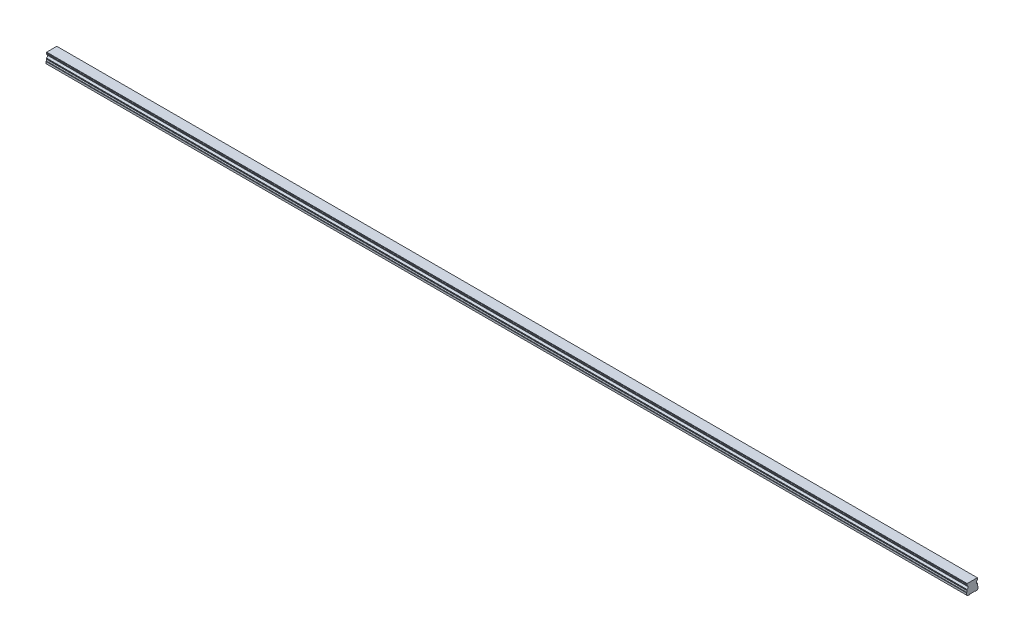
ISO-10303-21;
HEADER;
FILE_DESCRIPTION(('STEP AP214'),'2;1');
FILE_NAME('part.step','',(''),(''),'','','');
FILE_SCHEMA(('AUTOMOTIVE_DESIGN { 1 0 10303 214 1 1 1 1 }'));
ENDSEC;
DATA;
#1=APPLICATION_CONTEXT('core data for automotive mechanical design processes');
#2=APPLICATION_PROTOCOL_DEFINITION('international standard','automotive_design',2000,#1);
#3=PRODUCT_CONTEXT('',#1,'mechanical');
#4=PRODUCT('Part','Part','',(#3));
#5=PRODUCT_RELATED_PRODUCT_CATEGORY('part','',(#4));
#6=PRODUCT_DEFINITION_FORMATION('','',#4);
#7=PRODUCT_DEFINITION_CONTEXT('part definition',#1,'design');
#8=PRODUCT_DEFINITION('design','',#6,#7);
#9=PRODUCT_DEFINITION_SHAPE('','',#8);
#10=(LENGTH_UNIT() NAMED_UNIT(*) SI_UNIT(.MILLI.,.METRE.));
#11=(NAMED_UNIT(*) PLANE_ANGLE_UNIT() SI_UNIT($,.RADIAN.));
#12=(NAMED_UNIT(*) SI_UNIT($,.STERADIAN.) SOLID_ANGLE_UNIT());
#13=UNCERTAINTY_MEASURE_WITH_UNIT(LENGTH_MEASURE(1.E-05),#10,'distance_accuracy_value','');
#14=(GEOMETRIC_REPRESENTATION_CONTEXT(3) GLOBAL_UNCERTAINTY_ASSIGNED_CONTEXT((#13)) GLOBAL_UNIT_ASSIGNED_CONTEXT((#10,
#11,#12)) REPRESENTATION_CONTEXT('',''));
#15=CARTESIAN_POINT('',(0.,0.,0.));
#16=DIRECTION('',(0.,0.,1.));
#17=DIRECTION('',(1.,0.,0.));
#18=AXIS2_PLACEMENT_3D('',#15,#16,#17);
#19=CARTESIAN_POINT('',(1170.,0.399999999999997,0.));
#20=DIRECTION('',(0.,-1.,0.));
#21=DIRECTION('',(0.,0.,-1.));
#22=AXIS2_PLACEMENT_3D('',#19,#20,#21);
#23=CONICAL_SURFACE('',#22,2.90000000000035,0.785398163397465);
#24=CARTESIAN_POINT('',(1170.,0.800000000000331,0.));
#25=DIRECTION('',(0.,1.,0.));
#26=DIRECTION('',(0.,0.,1.));
#27=AXIS2_PLACEMENT_3D('',#24,#25,#26);
#28=CIRCLE('',#27,2.5);
#29=CARTESIAN_POINT('',(1170.,0.800000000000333,2.5));
#30=VERTEX_POINT('',#29);
#31=EDGE_CURVE('E11',#30,#30,#28,.F.);
#32=ORIENTED_EDGE('',*,*,#31,.F.);
#33=EDGE_LOOP('',(#32));
#34=FACE_BOUND('',#33,.T.);
#35=CARTESIAN_POINT('',(1170.,0.399999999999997,0.));
#36=DIRECTION('',(0.,1.,0.));
#37=DIRECTION('',(0.,0.,1.));
#38=AXIS2_PLACEMENT_3D('',#35,#36,#37);
#39=CIRCLE('',#38,2.90000000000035);
#40=CARTESIAN_POINT('',(1170.,0.399999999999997,2.90000000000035));
#41=VERTEX_POINT('',#40);
#42=EDGE_CURVE('E638',#41,#41,#39,.T.);
#43=ORIENTED_EDGE('',*,*,#42,.F.);
#44=EDGE_LOOP('',(#43));
#45=FACE_BOUND('',#44,.T.);
#46=ADVANCED_FACE('F39',(#34,#45),#23,.F.);
#47=CARTESIAN_POINT('',(1170.,7.,0.));
#48=DIRECTION('',(0.,-1.,0.));
#49=DIRECTION('',(0.,0.,-1.));
#50=AXIS2_PLACEMENT_3D('',#47,#48,#49);
#51=CYLINDRICAL_SURFACE('',#50,2.5);
#52=ORIENTED_EDGE('',*,*,#31,.T.);
#53=EDGE_LOOP('',(#52));
#54=FACE_BOUND('',#53,.T.);
#55=CARTESIAN_POINT('',(1170.,7.,0.));
#56=DIRECTION('',(0.,-1.,0.));
#57=DIRECTION('',(0.,0.,-1.));
#58=AXIS2_PLACEMENT_3D('',#55,#56,#57);
#59=CIRCLE('',#58,2.5);
#60=CARTESIAN_POINT('',(1170.,7.,-2.50000000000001));
#61=VERTEX_POINT('',#60);
#62=EDGE_CURVE('E49',#61,#61,#59,.T.);
#63=ORIENTED_EDGE('',*,*,#62,.F.);
#64=EDGE_LOOP('',(#63));
#65=FACE_BOUND('',#64,.T.);
#66=ADVANCED_FACE('F845',(#54,#65),#51,.F.);
#67=CARTESIAN_POINT('',(1170.,7.,0.));
#68=DIRECTION('',(0.,-1.,0.));
#69=DIRECTION('',(0.,0.,-1.));
#70=AXIS2_PLACEMENT_3D('',#67,#68,#69);
#71=PLANE('',#70);
#72=CARTESIAN_POINT('',(1170.,7.,0.));
#73=DIRECTION('',(0.,-1.,0.));
#74=DIRECTION('',(0.,0.,-1.));
#75=AXIS2_PLACEMENT_3D('',#72,#73,#74);
#76=CIRCLE('',#75,2.1);
#77=CARTESIAN_POINT('',(1170.,7.,-2.1));
#78=VERTEX_POINT('',#77);
#79=EDGE_CURVE('E42',#78,#78,#76,.T.);
#80=ORIENTED_EDGE('',*,*,#79,.F.);
#81=EDGE_LOOP('',(#80));
#82=FACE_BOUND('',#81,.T.);
#83=ORIENTED_EDGE('',*,*,#62,.T.);
#84=EDGE_LOOP('',(#83));
#85=FACE_BOUND('',#84,.T.);
#86=ADVANCED_FACE('F850',(#82,#85),#71,.T.);
#87=CARTESIAN_POINT('',(1110.,0.399999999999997,0.));
#88=DIRECTION('',(0.,-1.,0.));
#89=DIRECTION('',(0.,0.,-1.));
#90=AXIS2_PLACEMENT_3D('',#87,#88,#89);
#91=CONICAL_SURFACE('',#90,2.90000000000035,0.785398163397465);
#92=CARTESIAN_POINT('',(1110.,0.800000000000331,0.));
#93=DIRECTION('',(0.,1.,0.));
#94=DIRECTION('',(0.,0.,1.));
#95=AXIS2_PLACEMENT_3D('',#92,#93,#94);
#96=CIRCLE('',#95,2.5);
#97=CARTESIAN_POINT('',(1110.,0.800000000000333,2.5));
#98=VERTEX_POINT('',#97);
#99=EDGE_CURVE('E634',#98,#98,#96,.F.);
#100=ORIENTED_EDGE('',*,*,#99,.F.);
#101=EDGE_LOOP('',(#100));
#102=FACE_BOUND('',#101,.T.);
#103=CARTESIAN_POINT('',(1110.,0.399999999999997,0.));
#104=DIRECTION('',(0.,1.,0.));
#105=DIRECTION('',(0.,0.,1.));
#106=AXIS2_PLACEMENT_3D('',#103,#104,#105);
#107=CIRCLE('',#106,2.90000000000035);
#108=CARTESIAN_POINT('',(1110.,0.399999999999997,2.90000000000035));
#109=VERTEX_POINT('',#108);
#110=EDGE_CURVE('E626',#109,#109,#107,.T.);
#111=ORIENTED_EDGE('',*,*,#110,.F.);
#112=EDGE_LOOP('',(#111));
#113=FACE_BOUND('',#112,.T.);
#114=ADVANCED_FACE('F1127',(#102,#113),#91,.F.);
#115=CARTESIAN_POINT('',(1110.,7.,0.));
#116=DIRECTION('',(0.,-1.,0.));
#117=DIRECTION('',(0.,0.,-1.));
#118=AXIS2_PLACEMENT_3D('',#115,#116,#117);
#119=CYLINDRICAL_SURFACE('',#118,2.5);
#120=ORIENTED_EDGE('',*,*,#99,.T.);
#121=EDGE_LOOP('',(#120));
#122=FACE_BOUND('',#121,.T.);
#123=CARTESIAN_POINT('',(1110.,7.,0.));
#124=DIRECTION('',(0.,-1.,0.));
#125=DIRECTION('',(0.,0.,-1.));
#126=AXIS2_PLACEMENT_3D('',#123,#124,#125);
#127=CIRCLE('',#126,2.5);
#128=CARTESIAN_POINT('',(1110.,7.,-2.50000000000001));
#129=VERTEX_POINT('',#128);
#130=EDGE_CURVE('E630',#129,#129,#127,.T.);
#131=ORIENTED_EDGE('',*,*,#130,.F.);
#132=EDGE_LOOP('',(#131));
#133=FACE_BOUND('',#132,.T.);
#134=ADVANCED_FACE('F1123',(#122,#133),#119,.F.);
#135=CARTESIAN_POINT('',(1110.,7.,0.));
#136=DIRECTION('',(0.,-1.,0.));
#137=DIRECTION('',(0.,0.,-1.));
#138=AXIS2_PLACEMENT_3D('',#135,#136,#137);
#139=PLANE('',#138);
#140=CARTESIAN_POINT('',(1110.,7.,0.));
#141=DIRECTION('',(0.,-1.,0.));
#142=DIRECTION('',(0.,0.,-1.));
#143=AXIS2_PLACEMENT_3D('',#140,#141,#142);
#144=CIRCLE('',#143,2.1);
#145=CARTESIAN_POINT('',(1110.,7.,-2.1));
#146=VERTEX_POINT('',#145);
#147=EDGE_CURVE('E713',#146,#146,#144,.T.);
#148=ORIENTED_EDGE('',*,*,#147,.F.);
#149=EDGE_LOOP('',(#148));
#150=FACE_BOUND('',#149,.T.);
#151=ORIENTED_EDGE('',*,*,#130,.T.);
#152=EDGE_LOOP('',(#151));
#153=FACE_BOUND('',#152,.T.);
#154=ADVANCED_FACE('F1119',(#150,#153),#139,.T.);
#155=CARTESIAN_POINT('',(1050.,0.399999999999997,0.));
#156=DIRECTION('',(0.,-1.,0.));
#157=DIRECTION('',(0.,0.,-1.));
#158=AXIS2_PLACEMENT_3D('',#155,#156,#157);
#159=CONICAL_SURFACE('',#158,2.90000000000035,0.785398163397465);
#160=CARTESIAN_POINT('',(1050.,0.800000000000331,0.));
#161=DIRECTION('',(0.,1.,0.));
#162=DIRECTION('',(0.,0.,1.));
#163=AXIS2_PLACEMENT_3D('',#160,#161,#162);
#164=CIRCLE('',#163,2.5);
#165=CARTESIAN_POINT('',(1050.,0.800000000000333,2.5));
#166=VERTEX_POINT('',#165);
#167=EDGE_CURVE('E622',#166,#166,#164,.F.);
#168=ORIENTED_EDGE('',*,*,#167,.F.);
#169=EDGE_LOOP('',(#168));
#170=FACE_BOUND('',#169,.T.);
#171=CARTESIAN_POINT('',(1050.,0.399999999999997,0.));
#172=DIRECTION('',(0.,1.,0.));
#173=DIRECTION('',(0.,0.,1.));
#174=AXIS2_PLACEMENT_3D('',#171,#172,#173);
#175=CIRCLE('',#174,2.90000000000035);
#176=CARTESIAN_POINT('',(1050.,0.399999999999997,2.90000000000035));
#177=VERTEX_POINT('',#176);
#178=EDGE_CURVE('E614',#177,#177,#175,.T.);
#179=ORIENTED_EDGE('',*,*,#178,.F.);
#180=EDGE_LOOP('',(#179));
#181=FACE_BOUND('',#180,.T.);
#182=ADVANCED_FACE('F1115',(#170,#181),#159,.F.);
#183=CARTESIAN_POINT('',(1050.,7.,0.));
#184=DIRECTION('',(0.,-1.,0.));
#185=DIRECTION('',(0.,0.,-1.));
#186=AXIS2_PLACEMENT_3D('',#183,#184,#185);
#187=CYLINDRICAL_SURFACE('',#186,2.5);
#188=ORIENTED_EDGE('',*,*,#167,.T.);
#189=EDGE_LOOP('',(#188));
#190=FACE_BOUND('',#189,.T.);
#191=CARTESIAN_POINT('',(1050.,7.,0.));
#192=DIRECTION('',(0.,-1.,0.));
#193=DIRECTION('',(0.,0.,-1.));
#194=AXIS2_PLACEMENT_3D('',#191,#192,#193);
#195=CIRCLE('',#194,2.5);
#196=CARTESIAN_POINT('',(1050.,7.,-2.50000000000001));
#197=VERTEX_POINT('',#196);
#198=EDGE_CURVE('E618',#197,#197,#195,.T.);
#199=ORIENTED_EDGE('',*,*,#198,.F.);
#200=EDGE_LOOP('',(#199));
#201=FACE_BOUND('',#200,.T.);
#202=ADVANCED_FACE('F1111',(#190,#201),#187,.F.);
#203=CARTESIAN_POINT('',(1050.,7.,0.));
#204=DIRECTION('',(0.,-1.,0.));
#205=DIRECTION('',(0.,0.,-1.));
#206=AXIS2_PLACEMENT_3D('',#203,#204,#205);
#207=PLANE('',#206);
#208=CARTESIAN_POINT('',(1050.,7.,0.));
#209=DIRECTION('',(0.,-1.,0.));
#210=DIRECTION('',(0.,0.,-1.));
#211=AXIS2_PLACEMENT_3D('',#208,#209,#210);
#212=CIRCLE('',#211,2.1);
#213=CARTESIAN_POINT('',(1050.,7.,-2.1));
#214=VERTEX_POINT('',#213);
#215=EDGE_CURVE('E710',#214,#214,#212,.T.);
#216=ORIENTED_EDGE('',*,*,#215,.F.);
#217=EDGE_LOOP('',(#216));
#218=FACE_BOUND('',#217,.T.);
#219=ORIENTED_EDGE('',*,*,#198,.T.);
#220=EDGE_LOOP('',(#219));
#221=FACE_BOUND('',#220,.T.);
#222=ADVANCED_FACE('F1107',(#218,#221),#207,.T.);
#223=CARTESIAN_POINT('',(990.,0.399999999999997,0.));
#224=DIRECTION('',(0.,-1.,0.));
#225=DIRECTION('',(0.,0.,-1.));
#226=AXIS2_PLACEMENT_3D('',#223,#224,#225);
#227=CONICAL_SURFACE('',#226,2.90000000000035,0.785398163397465);
#228=CARTESIAN_POINT('',(990.,0.800000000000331,0.));
#229=DIRECTION('',(0.,1.,0.));
#230=DIRECTION('',(0.,0.,1.));
#231=AXIS2_PLACEMENT_3D('',#228,#229,#230);
#232=CIRCLE('',#231,2.5);
#233=CARTESIAN_POINT('',(990.,0.800000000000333,2.5));
#234=VERTEX_POINT('',#233);
#235=EDGE_CURVE('E610',#234,#234,#232,.F.);
#236=ORIENTED_EDGE('',*,*,#235,.F.);
#237=EDGE_LOOP('',(#236));
#238=FACE_BOUND('',#237,.T.);
#239=CARTESIAN_POINT('',(990.,0.399999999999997,0.));
#240=DIRECTION('',(0.,1.,0.));
#241=DIRECTION('',(0.,0.,1.));
#242=AXIS2_PLACEMENT_3D('',#239,#240,#241);
#243=CIRCLE('',#242,2.90000000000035);
#244=CARTESIAN_POINT('',(990.,0.399999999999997,2.90000000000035));
#245=VERTEX_POINT('',#244);
#246=EDGE_CURVE('E602',#245,#245,#243,.T.);
#247=ORIENTED_EDGE('',*,*,#246,.F.);
#248=EDGE_LOOP('',(#247));
#249=FACE_BOUND('',#248,.T.);
#250=ADVANCED_FACE('F1103',(#238,#249),#227,.F.);
#251=CARTESIAN_POINT('',(990.,7.,0.));
#252=DIRECTION('',(0.,-1.,0.));
#253=DIRECTION('',(0.,0.,-1.));
#254=AXIS2_PLACEMENT_3D('',#251,#252,#253);
#255=CYLINDRICAL_SURFACE('',#254,2.5);
#256=ORIENTED_EDGE('',*,*,#235,.T.);
#257=EDGE_LOOP('',(#256));
#258=FACE_BOUND('',#257,.T.);
#259=CARTESIAN_POINT('',(990.,7.,0.));
#260=DIRECTION('',(0.,-1.,0.));
#261=DIRECTION('',(0.,0.,-1.));
#262=AXIS2_PLACEMENT_3D('',#259,#260,#261);
#263=CIRCLE('',#262,2.5);
#264=CARTESIAN_POINT('',(990.,7.,-2.50000000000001));
#265=VERTEX_POINT('',#264);
#266=EDGE_CURVE('E606',#265,#265,#263,.T.);
#267=ORIENTED_EDGE('',*,*,#266,.F.);
#268=EDGE_LOOP('',(#267));
#269=FACE_BOUND('',#268,.T.);
#270=ADVANCED_FACE('F1099',(#258,#269),#255,.F.);
#271=CARTESIAN_POINT('',(990.,7.,0.));
#272=DIRECTION('',(0.,-1.,0.));
#273=DIRECTION('',(0.,0.,-1.));
#274=AXIS2_PLACEMENT_3D('',#271,#272,#273);
#275=PLANE('',#274);
#276=CARTESIAN_POINT('',(990.,7.,0.));
#277=DIRECTION('',(0.,-1.,0.));
#278=DIRECTION('',(0.,0.,-1.));
#279=AXIS2_PLACEMENT_3D('',#276,#277,#278);
#280=CIRCLE('',#279,2.1);
#281=CARTESIAN_POINT('',(990.,7.,-2.1));
#282=VERTEX_POINT('',#281);
#283=EDGE_CURVE('E706',#282,#282,#280,.T.);
#284=ORIENTED_EDGE('',*,*,#283,.F.);
#285=EDGE_LOOP('',(#284));
#286=FACE_BOUND('',#285,.T.);
#287=ORIENTED_EDGE('',*,*,#266,.T.);
#288=EDGE_LOOP('',(#287));
#289=FACE_BOUND('',#288,.T.);
#290=ADVANCED_FACE('F1095',(#286,#289),#275,.T.);
#291=CARTESIAN_POINT('',(930.,0.399999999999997,0.));
#292=DIRECTION('',(0.,-1.,0.));
#293=DIRECTION('',(0.,0.,-1.));
#294=AXIS2_PLACEMENT_3D('',#291,#292,#293);
#295=CONICAL_SURFACE('',#294,2.90000000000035,0.785398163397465);
#296=CARTESIAN_POINT('',(930.,0.800000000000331,0.));
#297=DIRECTION('',(0.,1.,0.));
#298=DIRECTION('',(0.,0.,1.));
#299=AXIS2_PLACEMENT_3D('',#296,#297,#298);
#300=CIRCLE('',#299,2.5);
#301=CARTESIAN_POINT('',(930.,0.800000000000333,2.5));
#302=VERTEX_POINT('',#301);
#303=EDGE_CURVE('E598',#302,#302,#300,.F.);
#304=ORIENTED_EDGE('',*,*,#303,.F.);
#305=EDGE_LOOP('',(#304));
#306=FACE_BOUND('',#305,.T.);
#307=CARTESIAN_POINT('',(930.,0.399999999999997,0.));
#308=DIRECTION('',(0.,1.,0.));
#309=DIRECTION('',(0.,0.,1.));
#310=AXIS2_PLACEMENT_3D('',#307,#308,#309);
#311=CIRCLE('',#310,2.90000000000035);
#312=CARTESIAN_POINT('',(930.,0.399999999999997,2.90000000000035));
#313=VERTEX_POINT('',#312);
#314=EDGE_CURVE('E590',#313,#313,#311,.T.);
#315=ORIENTED_EDGE('',*,*,#314,.F.);
#316=EDGE_LOOP('',(#315));
#317=FACE_BOUND('',#316,.T.);
#318=ADVANCED_FACE('F1091',(#306,#317),#295,.F.);
#319=CARTESIAN_POINT('',(930.,7.,0.));
#320=DIRECTION('',(0.,-1.,0.));
#321=DIRECTION('',(0.,0.,-1.));
#322=AXIS2_PLACEMENT_3D('',#319,#320,#321);
#323=CYLINDRICAL_SURFACE('',#322,2.5);
#324=ORIENTED_EDGE('',*,*,#303,.T.);
#325=EDGE_LOOP('',(#324));
#326=FACE_BOUND('',#325,.T.);
#327=CARTESIAN_POINT('',(930.,7.,0.));
#328=DIRECTION('',(0.,-1.,0.));
#329=DIRECTION('',(0.,0.,-1.));
#330=AXIS2_PLACEMENT_3D('',#327,#328,#329);
#331=CIRCLE('',#330,2.5);
#332=CARTESIAN_POINT('',(930.,7.,-2.50000000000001));
#333=VERTEX_POINT('',#332);
#334=EDGE_CURVE('E594',#333,#333,#331,.T.);
#335=ORIENTED_EDGE('',*,*,#334,.F.);
#336=EDGE_LOOP('',(#335));
#337=FACE_BOUND('',#336,.T.);
#338=ADVANCED_FACE('F1087',(#326,#337),#323,.F.);
#339=CARTESIAN_POINT('',(930.,7.,0.));
#340=DIRECTION('',(0.,-1.,0.));
#341=DIRECTION('',(0.,0.,-1.));
#342=AXIS2_PLACEMENT_3D('',#339,#340,#341);
#343=PLANE('',#342);
#344=CARTESIAN_POINT('',(930.,7.,0.));
#345=DIRECTION('',(0.,-1.,0.));
#346=DIRECTION('',(0.,0.,-1.));
#347=AXIS2_PLACEMENT_3D('',#344,#345,#346);
#348=CIRCLE('',#347,2.1);
#349=CARTESIAN_POINT('',(930.,7.,-2.1));
#350=VERTEX_POINT('',#349);
#351=EDGE_CURVE('E702',#350,#350,#348,.T.);
#352=ORIENTED_EDGE('',*,*,#351,.F.);
#353=EDGE_LOOP('',(#352));
#354=FACE_BOUND('',#353,.T.);
#355=ORIENTED_EDGE('',*,*,#334,.T.);
#356=EDGE_LOOP('',(#355));
#357=FACE_BOUND('',#356,.T.);
#358=ADVANCED_FACE('F1083',(#354,#357),#343,.T.);
#359=CARTESIAN_POINT('',(870.,0.399999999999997,0.));
#360=DIRECTION('',(0.,-1.,0.));
#361=DIRECTION('',(0.,0.,-1.));
#362=AXIS2_PLACEMENT_3D('',#359,#360,#361);
#363=CONICAL_SURFACE('',#362,2.90000000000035,0.785398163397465);
#364=CARTESIAN_POINT('',(870.,0.800000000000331,0.));
#365=DIRECTION('',(0.,1.,0.));
#366=DIRECTION('',(0.,0.,1.));
#367=AXIS2_PLACEMENT_3D('',#364,#365,#366);
#368=CIRCLE('',#367,2.5);
#369=CARTESIAN_POINT('',(870.,0.800000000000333,2.5));
#370=VERTEX_POINT('',#369);
#371=EDGE_CURVE('E586',#370,#370,#368,.F.);
#372=ORIENTED_EDGE('',*,*,#371,.F.);
#373=EDGE_LOOP('',(#372));
#374=FACE_BOUND('',#373,.T.);
#375=CARTESIAN_POINT('',(870.,0.399999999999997,0.));
#376=DIRECTION('',(0.,1.,0.));
#377=DIRECTION('',(0.,0.,1.));
#378=AXIS2_PLACEMENT_3D('',#375,#376,#377);
#379=CIRCLE('',#378,2.90000000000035);
#380=CARTESIAN_POINT('',(870.,0.399999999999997,2.90000000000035));
#381=VERTEX_POINT('',#380);
#382=EDGE_CURVE('E578',#381,#381,#379,.T.);
#383=ORIENTED_EDGE('',*,*,#382,.F.);
#384=EDGE_LOOP('',(#383));
#385=FACE_BOUND('',#384,.T.);
#386=ADVANCED_FACE('F1079',(#374,#385),#363,.F.);
#387=CARTESIAN_POINT('',(870.,7.,0.));
#388=DIRECTION('',(0.,-1.,0.));
#389=DIRECTION('',(0.,0.,-1.));
#390=AXIS2_PLACEMENT_3D('',#387,#388,#389);
#391=CYLINDRICAL_SURFACE('',#390,2.5);
#392=ORIENTED_EDGE('',*,*,#371,.T.);
#393=EDGE_LOOP('',(#392));
#394=FACE_BOUND('',#393,.T.);
#395=CARTESIAN_POINT('',(870.,7.,0.));
#396=DIRECTION('',(0.,-1.,0.));
#397=DIRECTION('',(0.,0.,-1.));
#398=AXIS2_PLACEMENT_3D('',#395,#396,#397);
#399=CIRCLE('',#398,2.5);
#400=CARTESIAN_POINT('',(870.,7.,-2.50000000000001));
#401=VERTEX_POINT('',#400);
#402=EDGE_CURVE('E582',#401,#401,#399,.T.);
#403=ORIENTED_EDGE('',*,*,#402,.F.);
#404=EDGE_LOOP('',(#403));
#405=FACE_BOUND('',#404,.T.);
#406=ADVANCED_FACE('F1075',(#394,#405),#391,.F.);
#407=CARTESIAN_POINT('',(870.,7.,0.));
#408=DIRECTION('',(0.,-1.,0.));
#409=DIRECTION('',(0.,0.,-1.));
#410=AXIS2_PLACEMENT_3D('',#407,#408,#409);
#411=PLANE('',#410);
#412=CARTESIAN_POINT('',(870.,7.,0.));
#413=DIRECTION('',(0.,-1.,0.));
#414=DIRECTION('',(0.,0.,-1.));
#415=AXIS2_PLACEMENT_3D('',#412,#413,#414);
#416=CIRCLE('',#415,2.1);
#417=CARTESIAN_POINT('',(870.,7.,-2.1));
#418=VERTEX_POINT('',#417);
#419=EDGE_CURVE('E698',#418,#418,#416,.T.);
#420=ORIENTED_EDGE('',*,*,#419,.F.);
#421=EDGE_LOOP('',(#420));
#422=FACE_BOUND('',#421,.T.);
#423=ORIENTED_EDGE('',*,*,#402,.T.);
#424=EDGE_LOOP('',(#423));
#425=FACE_BOUND('',#424,.T.);
#426=ADVANCED_FACE('F1071',(#422,#425),#411,.T.);
#427=CARTESIAN_POINT('',(810.,0.399999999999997,0.));
#428=DIRECTION('',(0.,-1.,0.));
#429=DIRECTION('',(0.,0.,-1.));
#430=AXIS2_PLACEMENT_3D('',#427,#428,#429);
#431=CONICAL_SURFACE('',#430,2.90000000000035,0.785398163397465);
#432=CARTESIAN_POINT('',(810.,0.800000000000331,0.));
#433=DIRECTION('',(0.,1.,0.));
#434=DIRECTION('',(0.,0.,1.));
#435=AXIS2_PLACEMENT_3D('',#432,#433,#434);
#436=CIRCLE('',#435,2.5);
#437=CARTESIAN_POINT('',(810.,0.800000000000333,2.5));
#438=VERTEX_POINT('',#437);
#439=EDGE_CURVE('E574',#438,#438,#436,.F.);
#440=ORIENTED_EDGE('',*,*,#439,.F.);
#441=EDGE_LOOP('',(#440));
#442=FACE_BOUND('',#441,.T.);
#443=CARTESIAN_POINT('',(810.,0.399999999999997,0.));
#444=DIRECTION('',(0.,1.,0.));
#445=DIRECTION('',(0.,0.,1.));
#446=AXIS2_PLACEMENT_3D('',#443,#444,#445);
#447=CIRCLE('',#446,2.90000000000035);
#448=CARTESIAN_POINT('',(810.,0.399999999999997,2.90000000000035));
#449=VERTEX_POINT('',#448);
#450=EDGE_CURVE('E566',#449,#449,#447,.T.);
#451=ORIENTED_EDGE('',*,*,#450,.F.);
#452=EDGE_LOOP('',(#451));
#453=FACE_BOUND('',#452,.T.);
#454=ADVANCED_FACE('F1067',(#442,#453),#431,.F.);
#455=CARTESIAN_POINT('',(810.,7.,0.));
#456=DIRECTION('',(0.,-1.,0.));
#457=DIRECTION('',(0.,0.,-1.));
#458=AXIS2_PLACEMENT_3D('',#455,#456,#457);
#459=CYLINDRICAL_SURFACE('',#458,2.5);
#460=ORIENTED_EDGE('',*,*,#439,.T.);
#461=EDGE_LOOP('',(#460));
#462=FACE_BOUND('',#461,.T.);
#463=CARTESIAN_POINT('',(810.,7.,0.));
#464=DIRECTION('',(0.,-1.,0.));
#465=DIRECTION('',(0.,0.,-1.));
#466=AXIS2_PLACEMENT_3D('',#463,#464,#465);
#467=CIRCLE('',#466,2.5);
#468=CARTESIAN_POINT('',(810.,7.,-2.50000000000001));
#469=VERTEX_POINT('',#468);
#470=EDGE_CURVE('E570',#469,#469,#467,.T.);
#471=ORIENTED_EDGE('',*,*,#470,.F.);
#472=EDGE_LOOP('',(#471));
#473=FACE_BOUND('',#472,.T.);
#474=ADVANCED_FACE('F1063',(#462,#473),#459,.F.);
#475=CARTESIAN_POINT('',(810.,7.,0.));
#476=DIRECTION('',(0.,-1.,0.));
#477=DIRECTION('',(0.,0.,-1.));
#478=AXIS2_PLACEMENT_3D('',#475,#476,#477);
#479=PLANE('',#478);
#480=CARTESIAN_POINT('',(810.,7.,0.));
#481=DIRECTION('',(0.,-1.,0.));
#482=DIRECTION('',(0.,0.,-1.));
#483=AXIS2_PLACEMENT_3D('',#480,#481,#482);
#484=CIRCLE('',#483,2.1);
#485=CARTESIAN_POINT('',(810.,7.,-2.1));
#486=VERTEX_POINT('',#485);
#487=EDGE_CURVE('E694',#486,#486,#484,.T.);
#488=ORIENTED_EDGE('',*,*,#487,.F.);
#489=EDGE_LOOP('',(#488));
#490=FACE_BOUND('',#489,.T.);
#491=ORIENTED_EDGE('',*,*,#470,.T.);
#492=EDGE_LOOP('',(#491));
#493=FACE_BOUND('',#492,.T.);
#494=ADVANCED_FACE('F1059',(#490,#493),#479,.T.);
#495=CARTESIAN_POINT('',(750.,0.399999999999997,0.));
#496=DIRECTION('',(0.,-1.,0.));
#497=DIRECTION('',(0.,0.,-1.));
#498=AXIS2_PLACEMENT_3D('',#495,#496,#497);
#499=CONICAL_SURFACE('',#498,2.90000000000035,0.785398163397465);
#500=CARTESIAN_POINT('',(750.,0.800000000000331,0.));
#501=DIRECTION('',(0.,1.,0.));
#502=DIRECTION('',(0.,0.,1.));
#503=AXIS2_PLACEMENT_3D('',#500,#501,#502);
#504=CIRCLE('',#503,2.5);
#505=CARTESIAN_POINT('',(750.,0.800000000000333,2.5));
#506=VERTEX_POINT('',#505);
#507=EDGE_CURVE('E562',#506,#506,#504,.F.);
#508=ORIENTED_EDGE('',*,*,#507,.F.);
#509=EDGE_LOOP('',(#508));
#510=FACE_BOUND('',#509,.T.);
#511=CARTESIAN_POINT('',(750.,0.399999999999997,0.));
#512=DIRECTION('',(0.,1.,0.));
#513=DIRECTION('',(0.,0.,1.));
#514=AXIS2_PLACEMENT_3D('',#511,#512,#513);
#515=CIRCLE('',#514,2.90000000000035);
#516=CARTESIAN_POINT('',(750.,0.399999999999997,2.90000000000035));
#517=VERTEX_POINT('',#516);
#518=EDGE_CURVE('E554',#517,#517,#515,.T.);
#519=ORIENTED_EDGE('',*,*,#518,.F.);
#520=EDGE_LOOP('',(#519));
#521=FACE_BOUND('',#520,.T.);
#522=ADVANCED_FACE('F1055',(#510,#521),#499,.F.);
#523=CARTESIAN_POINT('',(750.,7.,0.));
#524=DIRECTION('',(0.,-1.,0.));
#525=DIRECTION('',(0.,0.,-1.));
#526=AXIS2_PLACEMENT_3D('',#523,#524,#525);
#527=CYLINDRICAL_SURFACE('',#526,2.5);
#528=ORIENTED_EDGE('',*,*,#507,.T.);
#529=EDGE_LOOP('',(#528));
#530=FACE_BOUND('',#529,.T.);
#531=CARTESIAN_POINT('',(750.,7.,0.));
#532=DIRECTION('',(0.,-1.,0.));
#533=DIRECTION('',(0.,0.,-1.));
#534=AXIS2_PLACEMENT_3D('',#531,#532,#533);
#535=CIRCLE('',#534,2.5);
#536=CARTESIAN_POINT('',(750.,7.,-2.50000000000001));
#537=VERTEX_POINT('',#536);
#538=EDGE_CURVE('E558',#537,#537,#535,.T.);
#539=ORIENTED_EDGE('',*,*,#538,.F.);
#540=EDGE_LOOP('',(#539));
#541=FACE_BOUND('',#540,.T.);
#542=ADVANCED_FACE('F1051',(#530,#541),#527,.F.);
#543=CARTESIAN_POINT('',(750.,7.,0.));
#544=DIRECTION('',(0.,-1.,0.));
#545=DIRECTION('',(0.,0.,-1.));
#546=AXIS2_PLACEMENT_3D('',#543,#544,#545);
#547=PLANE('',#546);
#548=CARTESIAN_POINT('',(750.,7.,0.));
#549=DIRECTION('',(0.,-1.,0.));
#550=DIRECTION('',(0.,0.,-1.));
#551=AXIS2_PLACEMENT_3D('',#548,#549,#550);
#552=CIRCLE('',#551,2.1);
#553=CARTESIAN_POINT('',(750.,7.,-2.1));
#554=VERTEX_POINT('',#553);
#555=EDGE_CURVE('E690',#554,#554,#552,.T.);
#556=ORIENTED_EDGE('',*,*,#555,.F.);
#557=EDGE_LOOP('',(#556));
#558=FACE_BOUND('',#557,.T.);
#559=ORIENTED_EDGE('',*,*,#538,.T.);
#560=EDGE_LOOP('',(#559));
#561=FACE_BOUND('',#560,.T.);
#562=ADVANCED_FACE('F1047',(#558,#561),#547,.T.);
#563=CARTESIAN_POINT('',(690.,0.399999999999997,0.));
#564=DIRECTION('',(0.,-1.,0.));
#565=DIRECTION('',(0.,0.,-1.));
#566=AXIS2_PLACEMENT_3D('',#563,#564,#565);
#567=CONICAL_SURFACE('',#566,2.90000000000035,0.785398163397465);
#568=CARTESIAN_POINT('',(690.,0.800000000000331,0.));
#569=DIRECTION('',(0.,1.,0.));
#570=DIRECTION('',(0.,0.,1.));
#571=AXIS2_PLACEMENT_3D('',#568,#569,#570);
#572=CIRCLE('',#571,2.5);
#573=CARTESIAN_POINT('',(690.,0.800000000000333,2.5));
#574=VERTEX_POINT('',#573);
#575=EDGE_CURVE('E550',#574,#574,#572,.F.);
#576=ORIENTED_EDGE('',*,*,#575,.F.);
#577=EDGE_LOOP('',(#576));
#578=FACE_BOUND('',#577,.T.);
#579=CARTESIAN_POINT('',(690.,0.399999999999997,0.));
#580=DIRECTION('',(0.,1.,0.));
#581=DIRECTION('',(0.,0.,1.));
#582=AXIS2_PLACEMENT_3D('',#579,#580,#581);
#583=CIRCLE('',#582,2.90000000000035);
#584=CARTESIAN_POINT('',(690.,0.399999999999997,2.90000000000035));
#585=VERTEX_POINT('',#584);
#586=EDGE_CURVE('E542',#585,#585,#583,.T.);
#587=ORIENTED_EDGE('',*,*,#586,.F.);
#588=EDGE_LOOP('',(#587));
#589=FACE_BOUND('',#588,.T.);
#590=ADVANCED_FACE('F1043',(#578,#589),#567,.F.);
#591=CARTESIAN_POINT('',(690.,7.,0.));
#592=DIRECTION('',(0.,-1.,0.));
#593=DIRECTION('',(0.,0.,-1.));
#594=AXIS2_PLACEMENT_3D('',#591,#592,#593);
#595=CYLINDRICAL_SURFACE('',#594,2.5);
#596=ORIENTED_EDGE('',*,*,#575,.T.);
#597=EDGE_LOOP('',(#596));
#598=FACE_BOUND('',#597,.T.);
#599=CARTESIAN_POINT('',(690.,7.,0.));
#600=DIRECTION('',(0.,-1.,0.));
#601=DIRECTION('',(0.,0.,-1.));
#602=AXIS2_PLACEMENT_3D('',#599,#600,#601);
#603=CIRCLE('',#602,2.5);
#604=CARTESIAN_POINT('',(690.,7.,-2.50000000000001));
#605=VERTEX_POINT('',#604);
#606=EDGE_CURVE('E546',#605,#605,#603,.T.);
#607=ORIENTED_EDGE('',*,*,#606,.F.);
#608=EDGE_LOOP('',(#607));
#609=FACE_BOUND('',#608,.T.);
#610=ADVANCED_FACE('F1039',(#598,#609),#595,.F.);
#611=CARTESIAN_POINT('',(690.,7.,0.));
#612=DIRECTION('',(0.,-1.,0.));
#613=DIRECTION('',(0.,0.,-1.));
#614=AXIS2_PLACEMENT_3D('',#611,#612,#613);
#615=PLANE('',#614);
#616=CARTESIAN_POINT('',(690.,7.,0.));
#617=DIRECTION('',(0.,-1.,0.));
#618=DIRECTION('',(0.,0.,-1.));
#619=AXIS2_PLACEMENT_3D('',#616,#617,#618);
#620=CIRCLE('',#619,2.1);
#621=CARTESIAN_POINT('',(690.,7.,-2.1));
#622=VERTEX_POINT('',#621);
#623=EDGE_CURVE('E686',#622,#622,#620,.T.);
#624=ORIENTED_EDGE('',*,*,#623,.F.);
#625=EDGE_LOOP('',(#624));
#626=FACE_BOUND('',#625,.T.);
#627=ORIENTED_EDGE('',*,*,#606,.T.);
#628=EDGE_LOOP('',(#627));
#629=FACE_BOUND('',#628,.T.);
#630=ADVANCED_FACE('F1035',(#626,#629),#615,.T.);
#631=CARTESIAN_POINT('',(630.,0.399999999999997,0.));
#632=DIRECTION('',(0.,-1.,0.));
#633=DIRECTION('',(0.,0.,-1.));
#634=AXIS2_PLACEMENT_3D('',#631,#632,#633);
#635=CONICAL_SURFACE('',#634,2.90000000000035,0.785398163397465);
#636=CARTESIAN_POINT('',(630.,0.800000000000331,0.));
#637=DIRECTION('',(0.,1.,0.));
#638=DIRECTION('',(0.,0.,1.));
#639=AXIS2_PLACEMENT_3D('',#636,#637,#638);
#640=CIRCLE('',#639,2.5);
#641=CARTESIAN_POINT('',(630.,0.800000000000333,2.5));
#642=VERTEX_POINT('',#641);
#643=EDGE_CURVE('E538',#642,#642,#640,.F.);
#644=ORIENTED_EDGE('',*,*,#643,.F.);
#645=EDGE_LOOP('',(#644));
#646=FACE_BOUND('',#645,.T.);
#647=CARTESIAN_POINT('',(630.,0.399999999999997,0.));
#648=DIRECTION('',(0.,1.,0.));
#649=DIRECTION('',(0.,0.,1.));
#650=AXIS2_PLACEMENT_3D('',#647,#648,#649);
#651=CIRCLE('',#650,2.90000000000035);
#652=CARTESIAN_POINT('',(630.,0.399999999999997,2.90000000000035));
#653=VERTEX_POINT('',#652);
#654=EDGE_CURVE('E530',#653,#653,#651,.T.);
#655=ORIENTED_EDGE('',*,*,#654,.F.);
#656=EDGE_LOOP('',(#655));
#657=FACE_BOUND('',#656,.T.);
#658=ADVANCED_FACE('F1031',(#646,#657),#635,.F.);
#659=CARTESIAN_POINT('',(630.,7.,0.));
#660=DIRECTION('',(0.,-1.,0.));
#661=DIRECTION('',(0.,0.,-1.));
#662=AXIS2_PLACEMENT_3D('',#659,#660,#661);
#663=CYLINDRICAL_SURFACE('',#662,2.5);
#664=ORIENTED_EDGE('',*,*,#643,.T.);
#665=EDGE_LOOP('',(#664));
#666=FACE_BOUND('',#665,.T.);
#667=CARTESIAN_POINT('',(630.,7.,0.));
#668=DIRECTION('',(0.,-1.,0.));
#669=DIRECTION('',(0.,0.,-1.));
#670=AXIS2_PLACEMENT_3D('',#667,#668,#669);
#671=CIRCLE('',#670,2.5);
#672=CARTESIAN_POINT('',(630.,7.,-2.50000000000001));
#673=VERTEX_POINT('',#672);
#674=EDGE_CURVE('E534',#673,#673,#671,.T.);
#675=ORIENTED_EDGE('',*,*,#674,.F.);
#676=EDGE_LOOP('',(#675));
#677=FACE_BOUND('',#676,.T.);
#678=ADVANCED_FACE('F1027',(#666,#677),#663,.F.);
#679=CARTESIAN_POINT('',(630.,7.,0.));
#680=DIRECTION('',(0.,-1.,0.));
#681=DIRECTION('',(0.,0.,-1.));
#682=AXIS2_PLACEMENT_3D('',#679,#680,#681);
#683=PLANE('',#682);
#684=CARTESIAN_POINT('',(630.,7.,0.));
#685=DIRECTION('',(0.,-1.,0.));
#686=DIRECTION('',(0.,0.,-1.));
#687=AXIS2_PLACEMENT_3D('',#684,#685,#686);
#688=CIRCLE('',#687,2.1);
#689=CARTESIAN_POINT('',(630.,7.,-2.1));
#690=VERTEX_POINT('',#689);
#691=EDGE_CURVE('E682',#690,#690,#688,.T.);
#692=ORIENTED_EDGE('',*,*,#691,.F.);
#693=EDGE_LOOP('',(#692));
#694=FACE_BOUND('',#693,.T.);
#695=ORIENTED_EDGE('',*,*,#674,.T.);
#696=EDGE_LOOP('',(#695));
#697=FACE_BOUND('',#696,.T.);
#698=ADVANCED_FACE('F1023',(#694,#697),#683,.T.);
#699=CARTESIAN_POINT('',(570.,0.399999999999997,0.));
#700=DIRECTION('',(0.,-1.,0.));
#701=DIRECTION('',(0.,0.,-1.));
#702=AXIS2_PLACEMENT_3D('',#699,#700,#701);
#703=CONICAL_SURFACE('',#702,2.90000000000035,0.785398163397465);
#704=CARTESIAN_POINT('',(570.,0.800000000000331,0.));
#705=DIRECTION('',(0.,1.,0.));
#706=DIRECTION('',(0.,0.,1.));
#707=AXIS2_PLACEMENT_3D('',#704,#705,#706);
#708=CIRCLE('',#707,2.5);
#709=CARTESIAN_POINT('',(570.,0.800000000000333,2.5));
#710=VERTEX_POINT('',#709);
#711=EDGE_CURVE('E526',#710,#710,#708,.F.);
#712=ORIENTED_EDGE('',*,*,#711,.F.);
#713=EDGE_LOOP('',(#712));
#714=FACE_BOUND('',#713,.T.);
#715=CARTESIAN_POINT('',(570.,0.399999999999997,0.));
#716=DIRECTION('',(0.,1.,0.));
#717=DIRECTION('',(0.,0.,1.));
#718=AXIS2_PLACEMENT_3D('',#715,#716,#717);
#719=CIRCLE('',#718,2.90000000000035);
#720=CARTESIAN_POINT('',(570.,0.399999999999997,2.90000000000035));
#721=VERTEX_POINT('',#720);
#722=EDGE_CURVE('E518',#721,#721,#719,.T.);
#723=ORIENTED_EDGE('',*,*,#722,.F.);
#724=EDGE_LOOP('',(#723));
#725=FACE_BOUND('',#724,.T.);
#726=ADVANCED_FACE('F1019',(#714,#725),#703,.F.);
#727=CARTESIAN_POINT('',(570.,7.,0.));
#728=DIRECTION('',(0.,-1.,0.));
#729=DIRECTION('',(0.,0.,-1.));
#730=AXIS2_PLACEMENT_3D('',#727,#728,#729);
#731=CYLINDRICAL_SURFACE('',#730,2.5);
#732=ORIENTED_EDGE('',*,*,#711,.T.);
#733=EDGE_LOOP('',(#732));
#734=FACE_BOUND('',#733,.T.);
#735=CARTESIAN_POINT('',(570.,7.,0.));
#736=DIRECTION('',(0.,-1.,0.));
#737=DIRECTION('',(0.,0.,-1.));
#738=AXIS2_PLACEMENT_3D('',#735,#736,#737);
#739=CIRCLE('',#738,2.5);
#740=CARTESIAN_POINT('',(570.,7.,-2.50000000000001));
#741=VERTEX_POINT('',#740);
#742=EDGE_CURVE('E522',#741,#741,#739,.T.);
#743=ORIENTED_EDGE('',*,*,#742,.F.);
#744=EDGE_LOOP('',(#743));
#745=FACE_BOUND('',#744,.T.);
#746=ADVANCED_FACE('F1015',(#734,#745),#731,.F.);
#747=CARTESIAN_POINT('',(570.,7.,0.));
#748=DIRECTION('',(0.,-1.,0.));
#749=DIRECTION('',(0.,0.,-1.));
#750=AXIS2_PLACEMENT_3D('',#747,#748,#749);
#751=PLANE('',#750);
#752=CARTESIAN_POINT('',(570.,7.,0.));
#753=DIRECTION('',(0.,-1.,0.));
#754=DIRECTION('',(0.,0.,-1.));
#755=AXIS2_PLACEMENT_3D('',#752,#753,#754);
#756=CIRCLE('',#755,2.1);
#757=CARTESIAN_POINT('',(570.,7.,-2.1));
#758=VERTEX_POINT('',#757);
#759=EDGE_CURVE('E678',#758,#758,#756,.T.);
#760=ORIENTED_EDGE('',*,*,#759,.F.);
#761=EDGE_LOOP('',(#760));
#762=FACE_BOUND('',#761,.T.);
#763=ORIENTED_EDGE('',*,*,#742,.T.);
#764=EDGE_LOOP('',(#763));
#765=FACE_BOUND('',#764,.T.);
#766=ADVANCED_FACE('F1011',(#762,#765),#751,.T.);
#767=CARTESIAN_POINT('',(510.,0.399999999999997,0.));
#768=DIRECTION('',(0.,-1.,0.));
#769=DIRECTION('',(0.,0.,-1.));
#770=AXIS2_PLACEMENT_3D('',#767,#768,#769);
#771=CONICAL_SURFACE('',#770,2.90000000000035,0.785398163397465);
#772=CARTESIAN_POINT('',(510.,0.800000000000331,0.));
#773=DIRECTION('',(0.,1.,0.));
#774=DIRECTION('',(0.,0.,1.));
#775=AXIS2_PLACEMENT_3D('',#772,#773,#774);
#776=CIRCLE('',#775,2.5);
#777=CARTESIAN_POINT('',(510.,0.800000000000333,2.5));
#778=VERTEX_POINT('',#777);
#779=EDGE_CURVE('E514',#778,#778,#776,.F.);
#780=ORIENTED_EDGE('',*,*,#779,.F.);
#781=EDGE_LOOP('',(#780));
#782=FACE_BOUND('',#781,.T.);
#783=CARTESIAN_POINT('',(510.,0.399999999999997,0.));
#784=DIRECTION('',(0.,1.,0.));
#785=DIRECTION('',(0.,0.,1.));
#786=AXIS2_PLACEMENT_3D('',#783,#784,#785);
#787=CIRCLE('',#786,2.90000000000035);
#788=CARTESIAN_POINT('',(510.,0.399999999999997,2.90000000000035));
#789=VERTEX_POINT('',#788);
#790=EDGE_CURVE('E506',#789,#789,#787,.T.);
#791=ORIENTED_EDGE('',*,*,#790,.F.);
#792=EDGE_LOOP('',(#791));
#793=FACE_BOUND('',#792,.T.);
#794=ADVANCED_FACE('F1007',(#782,#793),#771,.F.);
#795=CARTESIAN_POINT('',(510.,7.,0.));
#796=DIRECTION('',(0.,-1.,0.));
#797=DIRECTION('',(0.,0.,-1.));
#798=AXIS2_PLACEMENT_3D('',#795,#796,#797);
#799=CYLINDRICAL_SURFACE('',#798,2.5);
#800=ORIENTED_EDGE('',*,*,#779,.T.);
#801=EDGE_LOOP('',(#800));
#802=FACE_BOUND('',#801,.T.);
#803=CARTESIAN_POINT('',(510.,7.,0.));
#804=DIRECTION('',(0.,-1.,0.));
#805=DIRECTION('',(0.,0.,-1.));
#806=AXIS2_PLACEMENT_3D('',#803,#804,#805);
#807=CIRCLE('',#806,2.5);
#808=CARTESIAN_POINT('',(510.,7.,-2.50000000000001));
#809=VERTEX_POINT('',#808);
#810=EDGE_CURVE('E510',#809,#809,#807,.T.);
#811=ORIENTED_EDGE('',*,*,#810,.F.);
#812=EDGE_LOOP('',(#811));
#813=FACE_BOUND('',#812,.T.);
#814=ADVANCED_FACE('F1003',(#802,#813),#799,.F.);
#815=CARTESIAN_POINT('',(510.,7.,0.));
#816=DIRECTION('',(0.,-1.,0.));
#817=DIRECTION('',(0.,0.,-1.));
#818=AXIS2_PLACEMENT_3D('',#815,#816,#817);
#819=PLANE('',#818);
#820=CARTESIAN_POINT('',(510.,7.,0.));
#821=DIRECTION('',(0.,-1.,0.));
#822=DIRECTION('',(0.,0.,-1.));
#823=AXIS2_PLACEMENT_3D('',#820,#821,#822);
#824=CIRCLE('',#823,2.1);
#825=CARTESIAN_POINT('',(510.,7.,-2.1));
#826=VERTEX_POINT('',#825);
#827=EDGE_CURVE('E674',#826,#826,#824,.T.);
#828=ORIENTED_EDGE('',*,*,#827,.F.);
#829=EDGE_LOOP('',(#828));
#830=FACE_BOUND('',#829,.T.);
#831=ORIENTED_EDGE('',*,*,#810,.T.);
#832=EDGE_LOOP('',(#831));
#833=FACE_BOUND('',#832,.T.);
#834=ADVANCED_FACE('F999',(#830,#833),#819,.T.);
#835=CARTESIAN_POINT('',(450.,0.399999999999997,0.));
#836=DIRECTION('',(0.,-1.,0.));
#837=DIRECTION('',(0.,0.,-1.));
#838=AXIS2_PLACEMENT_3D('',#835,#836,#837);
#839=CONICAL_SURFACE('',#838,2.90000000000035,0.785398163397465);
#840=CARTESIAN_POINT('',(450.,0.800000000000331,0.));
#841=DIRECTION('',(0.,1.,0.));
#842=DIRECTION('',(0.,0.,1.));
#843=AXIS2_PLACEMENT_3D('',#840,#841,#842);
#844=CIRCLE('',#843,2.5);
#845=CARTESIAN_POINT('',(450.,0.800000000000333,2.5));
#846=VERTEX_POINT('',#845);
#847=EDGE_CURVE('E502',#846,#846,#844,.F.);
#848=ORIENTED_EDGE('',*,*,#847,.F.);
#849=EDGE_LOOP('',(#848));
#850=FACE_BOUND('',#849,.T.);
#851=CARTESIAN_POINT('',(450.,0.399999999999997,0.));
#852=DIRECTION('',(0.,1.,0.));
#853=DIRECTION('',(0.,0.,1.));
#854=AXIS2_PLACEMENT_3D('',#851,#852,#853);
#855=CIRCLE('',#854,2.90000000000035);
#856=CARTESIAN_POINT('',(450.,0.399999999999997,2.90000000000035));
#857=VERTEX_POINT('',#856);
#858=EDGE_CURVE('E494',#857,#857,#855,.T.);
#859=ORIENTED_EDGE('',*,*,#858,.F.);
#860=EDGE_LOOP('',(#859));
#861=FACE_BOUND('',#860,.T.);
#862=ADVANCED_FACE('F995',(#850,#861),#839,.F.);
#863=CARTESIAN_POINT('',(450.,7.,0.));
#864=DIRECTION('',(0.,-1.,0.));
#865=DIRECTION('',(0.,0.,-1.));
#866=AXIS2_PLACEMENT_3D('',#863,#864,#865);
#867=CYLINDRICAL_SURFACE('',#866,2.5);
#868=ORIENTED_EDGE('',*,*,#847,.T.);
#869=EDGE_LOOP('',(#868));
#870=FACE_BOUND('',#869,.T.);
#871=CARTESIAN_POINT('',(450.,7.,0.));
#872=DIRECTION('',(0.,-1.,0.));
#873=DIRECTION('',(0.,0.,-1.));
#874=AXIS2_PLACEMENT_3D('',#871,#872,#873);
#875=CIRCLE('',#874,2.5);
#876=CARTESIAN_POINT('',(450.,7.,-2.50000000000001));
#877=VERTEX_POINT('',#876);
#878=EDGE_CURVE('E498',#877,#877,#875,.T.);
#879=ORIENTED_EDGE('',*,*,#878,.F.);
#880=EDGE_LOOP('',(#879));
#881=FACE_BOUND('',#880,.T.);
#882=ADVANCED_FACE('F991',(#870,#881),#867,.F.);
#883=CARTESIAN_POINT('',(450.,7.,0.));
#884=DIRECTION('',(0.,-1.,0.));
#885=DIRECTION('',(0.,0.,-1.));
#886=AXIS2_PLACEMENT_3D('',#883,#884,#885);
#887=PLANE('',#886);
#888=CARTESIAN_POINT('',(450.,7.,0.));
#889=DIRECTION('',(0.,-1.,0.));
#890=DIRECTION('',(0.,0.,-1.));
#891=AXIS2_PLACEMENT_3D('',#888,#889,#890);
#892=CIRCLE('',#891,2.1);
#893=CARTESIAN_POINT('',(450.,7.,-2.1));
#894=VERTEX_POINT('',#893);
#895=EDGE_CURVE('E670',#894,#894,#892,.T.);
#896=ORIENTED_EDGE('',*,*,#895,.F.);
#897=EDGE_LOOP('',(#896));
#898=FACE_BOUND('',#897,.T.);
#899=ORIENTED_EDGE('',*,*,#878,.T.);
#900=EDGE_LOOP('',(#899));
#901=FACE_BOUND('',#900,.T.);
#902=ADVANCED_FACE('F987',(#898,#901),#887,.T.);
#903=CARTESIAN_POINT('',(390.,0.399999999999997,0.));
#904=DIRECTION('',(0.,-1.,0.));
#905=DIRECTION('',(0.,0.,-1.));
#906=AXIS2_PLACEMENT_3D('',#903,#904,#905);
#907=CONICAL_SURFACE('',#906,2.90000000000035,0.785398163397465);
#908=CARTESIAN_POINT('',(390.,0.800000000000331,0.));
#909=DIRECTION('',(0.,1.,0.));
#910=DIRECTION('',(0.,0.,1.));
#911=AXIS2_PLACEMENT_3D('',#908,#909,#910);
#912=CIRCLE('',#911,2.5);
#913=CARTESIAN_POINT('',(390.,0.800000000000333,2.5));
#914=VERTEX_POINT('',#913);
#915=EDGE_CURVE('E490',#914,#914,#912,.F.);
#916=ORIENTED_EDGE('',*,*,#915,.F.);
#917=EDGE_LOOP('',(#916));
#918=FACE_BOUND('',#917,.T.);
#919=CARTESIAN_POINT('',(390.,0.399999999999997,0.));
#920=DIRECTION('',(0.,1.,0.));
#921=DIRECTION('',(0.,0.,1.));
#922=AXIS2_PLACEMENT_3D('',#919,#920,#921);
#923=CIRCLE('',#922,2.90000000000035);
#924=CARTESIAN_POINT('',(390.,0.399999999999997,2.90000000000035));
#925=VERTEX_POINT('',#924);
#926=EDGE_CURVE('E482',#925,#925,#923,.T.);
#927=ORIENTED_EDGE('',*,*,#926,.F.);
#928=EDGE_LOOP('',(#927));
#929=FACE_BOUND('',#928,.T.);
#930=ADVANCED_FACE('F983',(#918,#929),#907,.F.);
#931=CARTESIAN_POINT('',(390.,7.,0.));
#932=DIRECTION('',(0.,-1.,0.));
#933=DIRECTION('',(0.,0.,-1.));
#934=AXIS2_PLACEMENT_3D('',#931,#932,#933);
#935=CYLINDRICAL_SURFACE('',#934,2.5);
#936=ORIENTED_EDGE('',*,*,#915,.T.);
#937=EDGE_LOOP('',(#936));
#938=FACE_BOUND('',#937,.T.);
#939=CARTESIAN_POINT('',(390.,7.,0.));
#940=DIRECTION('',(0.,-1.,0.));
#941=DIRECTION('',(0.,0.,-1.));
#942=AXIS2_PLACEMENT_3D('',#939,#940,#941);
#943=CIRCLE('',#942,2.5);
#944=CARTESIAN_POINT('',(390.,7.,-2.50000000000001));
#945=VERTEX_POINT('',#944);
#946=EDGE_CURVE('E486',#945,#945,#943,.T.);
#947=ORIENTED_EDGE('',*,*,#946,.F.);
#948=EDGE_LOOP('',(#947));
#949=FACE_BOUND('',#948,.T.);
#950=ADVANCED_FACE('F979',(#938,#949),#935,.F.);
#951=CARTESIAN_POINT('',(390.,7.,0.));
#952=DIRECTION('',(0.,-1.,0.));
#953=DIRECTION('',(0.,0.,-1.));
#954=AXIS2_PLACEMENT_3D('',#951,#952,#953);
#955=PLANE('',#954);
#956=CARTESIAN_POINT('',(390.,7.,0.));
#957=DIRECTION('',(0.,-1.,0.));
#958=DIRECTION('',(0.,0.,-1.));
#959=AXIS2_PLACEMENT_3D('',#956,#957,#958);
#960=CIRCLE('',#959,2.1);
#961=CARTESIAN_POINT('',(390.,7.,-2.1));
#962=VERTEX_POINT('',#961);
#963=EDGE_CURVE('E666',#962,#962,#960,.T.);
#964=ORIENTED_EDGE('',*,*,#963,.F.);
#965=EDGE_LOOP('',(#964));
#966=FACE_BOUND('',#965,.T.);
#967=ORIENTED_EDGE('',*,*,#946,.T.);
#968=EDGE_LOOP('',(#967));
#969=FACE_BOUND('',#968,.T.);
#970=ADVANCED_FACE('F975',(#966,#969),#955,.T.);
#971=CARTESIAN_POINT('',(330.,0.399999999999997,0.));
#972=DIRECTION('',(0.,-1.,0.));
#973=DIRECTION('',(0.,0.,-1.));
#974=AXIS2_PLACEMENT_3D('',#971,#972,#973);
#975=CONICAL_SURFACE('',#974,2.90000000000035,0.785398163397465);
#976=CARTESIAN_POINT('',(330.,0.800000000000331,0.));
#977=DIRECTION('',(0.,1.,0.));
#978=DIRECTION('',(0.,0.,1.));
#979=AXIS2_PLACEMENT_3D('',#976,#977,#978);
#980=CIRCLE('',#979,2.5);
#981=CARTESIAN_POINT('',(330.,0.800000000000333,2.5));
#982=VERTEX_POINT('',#981);
#983=EDGE_CURVE('E478',#982,#982,#980,.F.);
#984=ORIENTED_EDGE('',*,*,#983,.F.);
#985=EDGE_LOOP('',(#984));
#986=FACE_BOUND('',#985,.T.);
#987=CARTESIAN_POINT('',(330.,0.399999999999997,0.));
#988=DIRECTION('',(0.,1.,0.));
#989=DIRECTION('',(0.,0.,1.));
#990=AXIS2_PLACEMENT_3D('',#987,#988,#989);
#991=CIRCLE('',#990,2.90000000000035);
#992=CARTESIAN_POINT('',(330.,0.399999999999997,2.90000000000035));
#993=VERTEX_POINT('',#992);
#994=EDGE_CURVE('E470',#993,#993,#991,.T.);
#995=ORIENTED_EDGE('',*,*,#994,.F.);
#996=EDGE_LOOP('',(#995));
#997=FACE_BOUND('',#996,.T.);
#998=ADVANCED_FACE('F971',(#986,#997),#975,.F.);
#999=CARTESIAN_POINT('',(330.,7.,0.));
#1000=DIRECTION('',(0.,-1.,0.));
#1001=DIRECTION('',(0.,0.,-1.));
#1002=AXIS2_PLACEMENT_3D('',#999,#1000,#1001);
#1003=CYLINDRICAL_SURFACE('',#1002,2.5);
#1004=ORIENTED_EDGE('',*,*,#983,.T.);
#1005=EDGE_LOOP('',(#1004));
#1006=FACE_BOUND('',#1005,.T.);
#1007=CARTESIAN_POINT('',(330.,7.,0.));
#1008=DIRECTION('',(0.,-1.,0.));
#1009=DIRECTION('',(0.,0.,-1.));
#1010=AXIS2_PLACEMENT_3D('',#1007,#1008,#1009);
#1011=CIRCLE('',#1010,2.5);
#1012=CARTESIAN_POINT('',(330.,7.,-2.50000000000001));
#1013=VERTEX_POINT('',#1012);
#1014=EDGE_CURVE('E474',#1013,#1013,#1011,.T.);
#1015=ORIENTED_EDGE('',*,*,#1014,.F.);
#1016=EDGE_LOOP('',(#1015));
#1017=FACE_BOUND('',#1016,.T.);
#1018=ADVANCED_FACE('F967',(#1006,#1017),#1003,.F.);
#1019=CARTESIAN_POINT('',(330.,7.,0.));
#1020=DIRECTION('',(0.,-1.,0.));
#1021=DIRECTION('',(0.,0.,-1.));
#1022=AXIS2_PLACEMENT_3D('',#1019,#1020,#1021);
#1023=PLANE('',#1022);
#1024=CARTESIAN_POINT('',(330.,7.,0.));
#1025=DIRECTION('',(0.,-1.,0.));
#1026=DIRECTION('',(0.,0.,-1.));
#1027=AXIS2_PLACEMENT_3D('',#1024,#1025,#1026);
#1028=CIRCLE('',#1027,2.1);
#1029=CARTESIAN_POINT('',(330.,7.,-2.1));
#1030=VERTEX_POINT('',#1029);
#1031=EDGE_CURVE('E662',#1030,#1030,#1028,.T.);
#1032=ORIENTED_EDGE('',*,*,#1031,.F.);
#1033=EDGE_LOOP('',(#1032));
#1034=FACE_BOUND('',#1033,.T.);
#1035=ORIENTED_EDGE('',*,*,#1014,.T.);
#1036=EDGE_LOOP('',(#1035));
#1037=FACE_BOUND('',#1036,.T.);
#1038=ADVANCED_FACE('F963',(#1034,#1037),#1023,.T.);
#1039=CARTESIAN_POINT('',(270.,0.399999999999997,0.));
#1040=DIRECTION('',(0.,-1.,0.));
#1041=DIRECTION('',(0.,0.,-1.));
#1042=AXIS2_PLACEMENT_3D('',#1039,#1040,#1041);
#1043=CONICAL_SURFACE('',#1042,2.90000000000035,0.785398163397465);
#1044=CARTESIAN_POINT('',(270.,0.800000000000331,0.));
#1045=DIRECTION('',(0.,1.,0.));
#1046=DIRECTION('',(0.,0.,1.));
#1047=AXIS2_PLACEMENT_3D('',#1044,#1045,#1046);
#1048=CIRCLE('',#1047,2.5);
#1049=CARTESIAN_POINT('',(270.,0.800000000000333,2.5));
#1050=VERTEX_POINT('',#1049);
#1051=EDGE_CURVE('E466',#1050,#1050,#1048,.F.);
#1052=ORIENTED_EDGE('',*,*,#1051,.F.);
#1053=EDGE_LOOP('',(#1052));
#1054=FACE_BOUND('',#1053,.T.);
#1055=CARTESIAN_POINT('',(270.,0.399999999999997,0.));
#1056=DIRECTION('',(0.,1.,0.));
#1057=DIRECTION('',(0.,0.,1.));
#1058=AXIS2_PLACEMENT_3D('',#1055,#1056,#1057);
#1059=CIRCLE('',#1058,2.90000000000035);
#1060=CARTESIAN_POINT('',(270.,0.399999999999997,2.90000000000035));
#1061=VERTEX_POINT('',#1060);
#1062=EDGE_CURVE('E458',#1061,#1061,#1059,.T.);
#1063=ORIENTED_EDGE('',*,*,#1062,.F.);
#1064=EDGE_LOOP('',(#1063));
#1065=FACE_BOUND('',#1064,.T.);
#1066=ADVANCED_FACE('F959',(#1054,#1065),#1043,.F.);
#1067=CARTESIAN_POINT('',(270.,7.,0.));
#1068=DIRECTION('',(0.,-1.,0.));
#1069=DIRECTION('',(0.,0.,-1.));
#1070=AXIS2_PLACEMENT_3D('',#1067,#1068,#1069);
#1071=CYLINDRICAL_SURFACE('',#1070,2.5);
#1072=ORIENTED_EDGE('',*,*,#1051,.T.);
#1073=EDGE_LOOP('',(#1072));
#1074=FACE_BOUND('',#1073,.T.);
#1075=CARTESIAN_POINT('',(270.,7.,0.));
#1076=DIRECTION('',(0.,-1.,0.));
#1077=DIRECTION('',(0.,0.,-1.));
#1078=AXIS2_PLACEMENT_3D('',#1075,#1076,#1077);
#1079=CIRCLE('',#1078,2.5);
#1080=CARTESIAN_POINT('',(270.,7.,-2.50000000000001));
#1081=VERTEX_POINT('',#1080);
#1082=EDGE_CURVE('E462',#1081,#1081,#1079,.T.);
#1083=ORIENTED_EDGE('',*,*,#1082,.F.);
#1084=EDGE_LOOP('',(#1083));
#1085=FACE_BOUND('',#1084,.T.);
#1086=ADVANCED_FACE('F955',(#1074,#1085),#1071,.F.);
#1087=CARTESIAN_POINT('',(270.,7.,0.));
#1088=DIRECTION('',(0.,-1.,0.));
#1089=DIRECTION('',(0.,0.,-1.));
#1090=AXIS2_PLACEMENT_3D('',#1087,#1088,#1089);
#1091=PLANE('',#1090);
#1092=CARTESIAN_POINT('',(270.,7.,0.));
#1093=DIRECTION('',(0.,-1.,0.));
#1094=DIRECTION('',(0.,0.,-1.));
#1095=AXIS2_PLACEMENT_3D('',#1092,#1093,#1094);
#1096=CIRCLE('',#1095,2.1);
#1097=CARTESIAN_POINT('',(270.,7.,-2.1));
#1098=VERTEX_POINT('',#1097);
#1099=EDGE_CURVE('E658',#1098,#1098,#1096,.T.);
#1100=ORIENTED_EDGE('',*,*,#1099,.F.);
#1101=EDGE_LOOP('',(#1100));
#1102=FACE_BOUND('',#1101,.T.);
#1103=ORIENTED_EDGE('',*,*,#1082,.T.);
#1104=EDGE_LOOP('',(#1103));
#1105=FACE_BOUND('',#1104,.T.);
#1106=ADVANCED_FACE('F951',(#1102,#1105),#1091,.T.);
#1107=CARTESIAN_POINT('',(210.,0.399999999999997,0.));
#1108=DIRECTION('',(0.,-1.,0.));
#1109=DIRECTION('',(0.,0.,-1.));
#1110=AXIS2_PLACEMENT_3D('',#1107,#1108,#1109);
#1111=CONICAL_SURFACE('',#1110,2.90000000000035,0.785398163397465);
#1112=CARTESIAN_POINT('',(210.,0.800000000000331,0.));
#1113=DIRECTION('',(0.,1.,0.));
#1114=DIRECTION('',(0.,0.,1.));
#1115=AXIS2_PLACEMENT_3D('',#1112,#1113,#1114);
#1116=CIRCLE('',#1115,2.5);
#1117=CARTESIAN_POINT('',(210.,0.800000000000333,2.5));
#1118=VERTEX_POINT('',#1117);
#1119=EDGE_CURVE('E454',#1118,#1118,#1116,.F.);
#1120=ORIENTED_EDGE('',*,*,#1119,.F.);
#1121=EDGE_LOOP('',(#1120));
#1122=FACE_BOUND('',#1121,.T.);
#1123=CARTESIAN_POINT('',(210.,0.399999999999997,0.));
#1124=DIRECTION('',(0.,1.,0.));
#1125=DIRECTION('',(0.,0.,1.));
#1126=AXIS2_PLACEMENT_3D('',#1123,#1124,#1125);
#1127=CIRCLE('',#1126,2.90000000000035);
#1128=CARTESIAN_POINT('',(210.,0.399999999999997,2.90000000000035));
#1129=VERTEX_POINT('',#1128);
#1130=EDGE_CURVE('E446',#1129,#1129,#1127,.T.);
#1131=ORIENTED_EDGE('',*,*,#1130,.F.);
#1132=EDGE_LOOP('',(#1131));
#1133=FACE_BOUND('',#1132,.T.);
#1134=ADVANCED_FACE('F947',(#1122,#1133),#1111,.F.);
#1135=CARTESIAN_POINT('',(210.,7.,0.));
#1136=DIRECTION('',(0.,-1.,0.));
#1137=DIRECTION('',(0.,0.,-1.));
#1138=AXIS2_PLACEMENT_3D('',#1135,#1136,#1137);
#1139=CYLINDRICAL_SURFACE('',#1138,2.5);
#1140=ORIENTED_EDGE('',*,*,#1119,.T.);
#1141=EDGE_LOOP('',(#1140));
#1142=FACE_BOUND('',#1141,.T.);
#1143=CARTESIAN_POINT('',(210.,7.,0.));
#1144=DIRECTION('',(0.,-1.,0.));
#1145=DIRECTION('',(0.,0.,-1.));
#1146=AXIS2_PLACEMENT_3D('',#1143,#1144,#1145);
#1147=CIRCLE('',#1146,2.5);
#1148=CARTESIAN_POINT('',(210.,7.,-2.50000000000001));
#1149=VERTEX_POINT('',#1148);
#1150=EDGE_CURVE('E450',#1149,#1149,#1147,.T.);
#1151=ORIENTED_EDGE('',*,*,#1150,.F.);
#1152=EDGE_LOOP('',(#1151));
#1153=FACE_BOUND('',#1152,.T.);
#1154=ADVANCED_FACE('F943',(#1142,#1153),#1139,.F.);
#1155=CARTESIAN_POINT('',(210.,7.,0.));
#1156=DIRECTION('',(0.,-1.,0.));
#1157=DIRECTION('',(0.,0.,-1.));
#1158=AXIS2_PLACEMENT_3D('',#1155,#1156,#1157);
#1159=PLANE('',#1158);
#1160=CARTESIAN_POINT('',(210.,7.,0.));
#1161=DIRECTION('',(0.,-1.,0.));
#1162=DIRECTION('',(0.,0.,-1.));
#1163=AXIS2_PLACEMENT_3D('',#1160,#1161,#1162);
#1164=CIRCLE('',#1163,2.1);
#1165=CARTESIAN_POINT('',(210.,7.,-2.1));
#1166=VERTEX_POINT('',#1165);
#1167=EDGE_CURVE('E654',#1166,#1166,#1164,.T.);
#1168=ORIENTED_EDGE('',*,*,#1167,.F.);
#1169=EDGE_LOOP('',(#1168));
#1170=FACE_BOUND('',#1169,.T.);
#1171=ORIENTED_EDGE('',*,*,#1150,.T.);
#1172=EDGE_LOOP('',(#1171));
#1173=FACE_BOUND('',#1172,.T.);
#1174=ADVANCED_FACE('F939',(#1170,#1173),#1159,.T.);
#1175=CARTESIAN_POINT('',(150.,0.399999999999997,0.));
#1176=DIRECTION('',(0.,-1.,0.));
#1177=DIRECTION('',(0.,0.,-1.));
#1178=AXIS2_PLACEMENT_3D('',#1175,#1176,#1177);
#1179=CONICAL_SURFACE('',#1178,2.90000000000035,0.785398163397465);
#1180=CARTESIAN_POINT('',(150.,0.800000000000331,0.));
#1181=DIRECTION('',(0.,1.,0.));
#1182=DIRECTION('',(0.,0.,1.));
#1183=AXIS2_PLACEMENT_3D('',#1180,#1181,#1182);
#1184=CIRCLE('',#1183,2.5);
#1185=CARTESIAN_POINT('',(150.,0.800000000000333,2.5));
#1186=VERTEX_POINT('',#1185);
#1187=EDGE_CURVE('E442',#1186,#1186,#1184,.F.);
#1188=ORIENTED_EDGE('',*,*,#1187,.F.);
#1189=EDGE_LOOP('',(#1188));
#1190=FACE_BOUND('',#1189,.T.);
#1191=CARTESIAN_POINT('',(150.,0.399999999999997,0.));
#1192=DIRECTION('',(0.,1.,0.));
#1193=DIRECTION('',(0.,0.,1.));
#1194=AXIS2_PLACEMENT_3D('',#1191,#1192,#1193);
#1195=CIRCLE('',#1194,2.90000000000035);
#1196=CARTESIAN_POINT('',(150.,0.399999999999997,2.90000000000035));
#1197=VERTEX_POINT('',#1196);
#1198=EDGE_CURVE('E434',#1197,#1197,#1195,.T.);
#1199=ORIENTED_EDGE('',*,*,#1198,.F.);
#1200=EDGE_LOOP('',(#1199));
#1201=FACE_BOUND('',#1200,.T.);
#1202=ADVANCED_FACE('F935',(#1190,#1201),#1179,.F.);
#1203=CARTESIAN_POINT('',(150.,7.,0.));
#1204=DIRECTION('',(0.,-1.,0.));
#1205=DIRECTION('',(0.,0.,-1.));
#1206=AXIS2_PLACEMENT_3D('',#1203,#1204,#1205);
#1207=CYLINDRICAL_SURFACE('',#1206,2.5);
#1208=ORIENTED_EDGE('',*,*,#1187,.T.);
#1209=EDGE_LOOP('',(#1208));
#1210=FACE_BOUND('',#1209,.T.);
#1211=CARTESIAN_POINT('',(150.,7.,0.));
#1212=DIRECTION('',(0.,-1.,0.));
#1213=DIRECTION('',(0.,0.,-1.));
#1214=AXIS2_PLACEMENT_3D('',#1211,#1212,#1213);
#1215=CIRCLE('',#1214,2.5);
#1216=CARTESIAN_POINT('',(150.,7.,-2.50000000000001));
#1217=VERTEX_POINT('',#1216);
#1218=EDGE_CURVE('E438',#1217,#1217,#1215,.T.);
#1219=ORIENTED_EDGE('',*,*,#1218,.F.);
#1220=EDGE_LOOP('',(#1219));
#1221=FACE_BOUND('',#1220,.T.);
#1222=ADVANCED_FACE('F931',(#1210,#1221),#1207,.F.);
#1223=CARTESIAN_POINT('',(150.,7.,0.));
#1224=DIRECTION('',(0.,-1.,0.));
#1225=DIRECTION('',(0.,0.,-1.));
#1226=AXIS2_PLACEMENT_3D('',#1223,#1224,#1225);
#1227=PLANE('',#1226);
#1228=CARTESIAN_POINT('',(150.,7.,0.));
#1229=DIRECTION('',(0.,-1.,0.));
#1230=DIRECTION('',(0.,0.,-1.));
#1231=AXIS2_PLACEMENT_3D('',#1228,#1229,#1230);
#1232=CIRCLE('',#1231,2.1);
#1233=CARTESIAN_POINT('',(150.,7.,-2.1));
#1234=VERTEX_POINT('',#1233);
#1235=EDGE_CURVE('E649',#1234,#1234,#1232,.T.);
#1236=ORIENTED_EDGE('',*,*,#1235,.F.);
#1237=EDGE_LOOP('',(#1236));
#1238=FACE_BOUND('',#1237,.T.);
#1239=ORIENTED_EDGE('',*,*,#1218,.T.);
#1240=EDGE_LOOP('',(#1239));
#1241=FACE_BOUND('',#1240,.T.);
#1242=ADVANCED_FACE('F922',(#1238,#1241),#1227,.T.);
#1243=CARTESIAN_POINT('',(1200.,14.,-6.59000000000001));
#1244=DIRECTION('',(0.,0.,1.));
#1245=DIRECTION('',(0.,-1.,0.));
#1246=AXIS2_PLACEMENT_3D('',#1243,#1244,#1245);
#1247=PLANE('',#1246);
#1248=DIRECTION('',(0.,1.,0.));
#1249=VECTOR('',#1248,1.);
#1250=CARTESIAN_POINT('',(0.,14.,-6.59000000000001));
#1251=LINE('',#1250,#1249);
#1252=CARTESIAN_POINT('',(0.,13.15,-6.59));
#1253=VERTEX_POINT('',#1252);
#1254=CARTESIAN_POINT('',(0.,14.,-6.59000000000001));
#1255=VERTEX_POINT('',#1254);
#1256=EDGE_CURVE('E255',#1253,#1255,#1251,.T.);
#1257=ORIENTED_EDGE('',*,*,#1256,.T.);
#1258=DIRECTION('',(-1.,0.,0.));
#1259=VECTOR('',#1258,1.);
#1260=CARTESIAN_POINT('',(1200.,14.,-6.59000000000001));
#1261=LINE('',#1260,#1259);
#1262=CARTESIAN_POINT('',(1200.,14.,-6.59000000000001));
#1263=VERTEX_POINT('',#1262);
#1264=EDGE_CURVE('E423',#1263,#1255,#1261,.T.);
#1265=ORIENTED_EDGE('',*,*,#1264,.F.);
#1266=DIRECTION('',(0.,1.,0.));
#1267=VECTOR('',#1266,1.);
#1268=CARTESIAN_POINT('',(1200.,14.,-6.59000000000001));
#1269=LINE('',#1268,#1267);
#1270=CARTESIAN_POINT('',(1200.,13.15,-6.59));
#1271=VERTEX_POINT('',#1270);
#1272=EDGE_CURVE('E332',#1271,#1263,#1269,.T.);
#1273=ORIENTED_EDGE('',*,*,#1272,.F.);
#1274=DIRECTION('',(-1.,0.,0.));
#1275=VECTOR('',#1274,1.);
#1276=CARTESIAN_POINT('',(1200.,13.15,-6.59));
#1277=LINE('',#1276,#1275);
#1278=EDGE_CURVE('E251',#1271,#1253,#1277,.T.);
#1279=ORIENTED_EDGE('',*,*,#1278,.T.);
#1280=EDGE_LOOP('',(#1257,#1265,#1273,#1279));
#1281=FACE_BOUND('',#1280,.T.);
#1282=ADVANCED_FACE('F832',(#1281),#1247,.F.);
#1283=CARTESIAN_POINT('',(1200.,14.,-6.59000000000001));
#1284=DIRECTION('',(0.,-1.,0.));
#1285=DIRECTION('',(0.,0.,-1.));
#1286=AXIS2_PLACEMENT_3D('',#1283,#1284,#1285);
#1287=PLANE('',#1286);
#1288=DIRECTION('',(0.,0.,1.));
#1289=VECTOR('',#1288,1.);
#1290=CARTESIAN_POINT('',(0.,14.,-6.59000000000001));
#1291=LINE('',#1290,#1289);
#1292=CARTESIAN_POINT('',(0.,14.,6.59));
#1293=VERTEX_POINT('',#1292);
#1294=EDGE_CURVE('E259',#1255,#1293,#1291,.T.);
#1295=ORIENTED_EDGE('',*,*,#1294,.T.);
#1296=DIRECTION('',(-1.,0.,0.));
#1297=VECTOR('',#1296,1.);
#1298=CARTESIAN_POINT('',(1200.,14.,6.59));
#1299=LINE('',#1298,#1297);
#1300=CARTESIAN_POINT('',(1200.,14.,6.59));
#1301=VERTEX_POINT('',#1300);
#1302=EDGE_CURVE('E419',#1301,#1293,#1299,.T.);
#1303=ORIENTED_EDGE('',*,*,#1302,.F.);
#1304=DIRECTION('',(0.,0.,1.));
#1305=VECTOR('',#1304,1.);
#1306=CARTESIAN_POINT('',(1200.,14.,-6.59000000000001));
#1307=LINE('',#1306,#1305);
#1308=EDGE_CURVE('E157',#1263,#1301,#1307,.T.);
#1309=ORIENTED_EDGE('',*,*,#1308,.F.);
#1310=ORIENTED_EDGE('',*,*,#1264,.T.);
#1311=EDGE_LOOP('',(#1295,#1303,#1309,#1310));
#1312=FACE_BOUND('',#1311,.T.);
#1313=ADVANCED_FACE('F916',(#1312),#1287,.F.);
#1314=CARTESIAN_POINT('',(1200.,14.,6.59));
#1315=DIRECTION('',(0.,0.,-1.));
#1316=DIRECTION('',(0.,1.,0.));
#1317=AXIS2_PLACEMENT_3D('',#1314,#1315,#1316);
#1318=PLANE('',#1317);
#1319=DIRECTION('',(0.,-1.,0.));
#1320=VECTOR('',#1319,1.);
#1321=CARTESIAN_POINT('',(0.,14.,6.59));
#1322=LINE('',#1321,#1320);
#1323=CARTESIAN_POINT('',(0.,13.15,6.59));
#1324=VERTEX_POINT('',#1323);
#1325=EDGE_CURVE('E263',#1293,#1324,#1322,.T.);
#1326=ORIENTED_EDGE('',*,*,#1325,.T.);
#1327=DIRECTION('',(-1.,0.,0.));
#1328=VECTOR('',#1327,1.);
#1329=CARTESIAN_POINT('',(1200.,13.15,6.59));
#1330=LINE('',#1329,#1328);
#1331=CARTESIAN_POINT('',(1200.,13.15,6.59));
#1332=VERTEX_POINT('',#1331);
#1333=EDGE_CURVE('E415',#1332,#1324,#1330,.T.);
#1334=ORIENTED_EDGE('',*,*,#1333,.F.);
#1335=DIRECTION('',(0.,-1.,0.));
#1336=VECTOR('',#1335,1.);
#1337=CARTESIAN_POINT('',(1200.,14.,6.59));
#1338=LINE('',#1337,#1336);
#1339=EDGE_CURVE('E758',#1301,#1332,#1338,.T.);
#1340=ORIENTED_EDGE('',*,*,#1339,.F.);
#1341=ORIENTED_EDGE('',*,*,#1302,.T.);
#1342=EDGE_LOOP('',(#1326,#1334,#1340,#1341));
#1343=FACE_BOUND('',#1342,.T.);
#1344=ADVANCED_FACE('F912',(#1343),#1318,.F.);
#1345=CARTESIAN_POINT('',(1200.,13.15,6.59));
#1346=DIRECTION('',(0.,-0.422618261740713,-0.906307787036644));
#1347=DIRECTION('',(0.,0.906307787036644,-0.422618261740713));
#1348=AXIS2_PLACEMENT_3D('',#1345,#1346,#1347);
#1349=PLANE('',#1348);
#1350=DIRECTION('',(0.,-0.906307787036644,0.422618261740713));
#1351=VECTOR('',#1350,1.);
#1352=CARTESIAN_POINT('',(0.,13.15,6.59));
#1353=LINE('',#1352,#1351);
#1354=CARTESIAN_POINT('',(0.,12.3565324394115,6.96));
#1355=VERTEX_POINT('',#1354);
#1356=EDGE_CURVE('E266',#1324,#1355,#1353,.T.);
#1357=ORIENTED_EDGE('',*,*,#1356,.T.);
#1358=DIRECTION('',(-1.,0.,0.));
#1359=VECTOR('',#1358,1.);
#1360=CARTESIAN_POINT('',(1200.,12.3565324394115,6.96));
#1361=LINE('',#1360,#1359);
#1362=CARTESIAN_POINT('',(1200.,12.3565324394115,6.96));
#1363=VERTEX_POINT('',#1362);
#1364=EDGE_CURVE('E411',#1363,#1355,#1361,.T.);
#1365=ORIENTED_EDGE('',*,*,#1364,.F.);
#1366=DIRECTION('',(0.,-0.906307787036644,0.422618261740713));
#1367=VECTOR('',#1366,1.);
#1368=CARTESIAN_POINT('',(1200.,13.15,6.59));
#1369=LINE('',#1368,#1367);
#1370=EDGE_CURVE('E761',#1332,#1363,#1369,.T.);
#1371=ORIENTED_EDGE('',*,*,#1370,.F.);
#1372=ORIENTED_EDGE('',*,*,#1333,.T.);
#1373=EDGE_LOOP('',(#1357,#1365,#1371,#1372));
#1374=FACE_BOUND('',#1373,.T.);
#1375=ADVANCED_FACE('F908',(#1374),#1349,.F.);
#1376=CARTESIAN_POINT('',(1200.,12.3565324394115,6.96));
#1377=DIRECTION('',(0.,0.,-1.));
#1378=DIRECTION('',(0.,1.,0.));
#1379=AXIS2_PLACEMENT_3D('',#1376,#1377,#1378);
#1380=PLANE('',#1379);
#1381=DIRECTION('',(0.,-1.,0.));
#1382=VECTOR('',#1381,1.);
#1383=CARTESIAN_POINT('',(0.,12.3565324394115,6.96));
#1384=LINE('',#1383,#1382);
#1385=CARTESIAN_POINT('',(0.,11.4351744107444,6.96));
#1386=VERTEX_POINT('',#1385);
#1387=EDGE_CURVE('E269',#1355,#1386,#1384,.T.);
#1388=ORIENTED_EDGE('',*,*,#1387,.T.);
#1389=DIRECTION('',(-1.,0.,0.));
#1390=VECTOR('',#1389,1.);
#1391=CARTESIAN_POINT('',(1200.,11.4351744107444,6.96));
#1392=LINE('',#1391,#1390);
#1393=CARTESIAN_POINT('',(1200.,11.4351744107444,6.96));
#1394=VERTEX_POINT('',#1393);
#1395=EDGE_CURVE('E407',#1394,#1386,#1392,.T.);
#1396=ORIENTED_EDGE('',*,*,#1395,.F.);
#1397=DIRECTION('',(0.,-1.,0.));
#1398=VECTOR('',#1397,1.);
#1399=CARTESIAN_POINT('',(1200.,12.3565324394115,6.96));
#1400=LINE('',#1399,#1398);
#1401=EDGE_CURVE('E764',#1363,#1394,#1400,.T.);
#1402=ORIENTED_EDGE('',*,*,#1401,.F.);
#1403=ORIENTED_EDGE('',*,*,#1364,.T.);
#1404=EDGE_LOOP('',(#1388,#1396,#1402,#1403));
#1405=FACE_BOUND('',#1404,.T.);
#1406=ADVANCED_FACE('F904',(#1405),#1380,.F.);
#1407=CARTESIAN_POINT('',(1200.,9.5,7.2));
#1408=DIRECTION('',(-1.,0.,0.));
#1409=DIRECTION('',(0.,0.,1.));
#1410=AXIS2_PLACEMENT_3D('',#1407,#1408,#1409);
#1411=CYLINDRICAL_SURFACE('',#1410,1.95);
#1412=CARTESIAN_POINT('',(0.,9.5,7.2));
#1413=DIRECTION('',(-1.,0.,0.));
#1414=DIRECTION('',(0.,0.,-1.));
#1415=AXIS2_PLACEMENT_3D('',#1412,#1413,#1414);
#1416=CIRCLE('',#1415,1.95);
#1417=CARTESIAN_POINT('',(0.,7.56482558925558,6.96));
#1418=VERTEX_POINT('',#1417);
#1419=EDGE_CURVE('E272',#1386,#1418,#1416,.T.);
#1420=ORIENTED_EDGE('',*,*,#1419,.T.);
#1421=DIRECTION('',(-1.,0.,0.));
#1422=VECTOR('',#1421,1.);
#1423=CARTESIAN_POINT('',(1200.,7.56482558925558,6.96));
#1424=LINE('',#1423,#1422);
#1425=CARTESIAN_POINT('',(1200.,7.56482558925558,6.96));
#1426=VERTEX_POINT('',#1425);
#1427=EDGE_CURVE('E403',#1426,#1418,#1424,.T.);
#1428=ORIENTED_EDGE('',*,*,#1427,.F.);
#1429=CARTESIAN_POINT('',(1200.,9.5,7.2));
#1430=DIRECTION('',(-1.,0.,0.));
#1431=DIRECTION('',(0.,0.,-1.));
#1432=AXIS2_PLACEMENT_3D('',#1429,#1430,#1431);
#1433=CIRCLE('',#1432,1.95);
#1434=EDGE_CURVE('E767',#1394,#1426,#1433,.T.);
#1435=ORIENTED_EDGE('',*,*,#1434,.F.);
#1436=ORIENTED_EDGE('',*,*,#1395,.T.);
#1437=EDGE_LOOP('',(#1420,#1428,#1435,#1436));
#1438=FACE_BOUND('',#1437,.T.);
#1439=ADVANCED_FACE('F900',(#1438),#1411,.F.);
#1440=CARTESIAN_POINT('',(1200.,7.56482558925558,6.96));
#1441=DIRECTION('',(0.,0.,-1.));
#1442=DIRECTION('',(0.,1.,0.));
#1443=AXIS2_PLACEMENT_3D('',#1440,#1441,#1442);
#1444=PLANE('',#1443);
#1445=DIRECTION('',(0.,-1.,0.));
#1446=VECTOR('',#1445,1.);
#1447=CARTESIAN_POINT('',(0.,7.56482558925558,6.96));
#1448=LINE('',#1447,#1446);
#1449=CARTESIAN_POINT('',(0.,6.64346756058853,6.96));
#1450=VERTEX_POINT('',#1449);
#1451=EDGE_CURVE('E275',#1418,#1450,#1448,.T.);
#1452=ORIENTED_EDGE('',*,*,#1451,.T.);
#1453=DIRECTION('',(-1.,0.,0.));
#1454=VECTOR('',#1453,1.);
#1455=CARTESIAN_POINT('',(1200.,6.64346756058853,6.96));
#1456=LINE('',#1455,#1454);
#1457=CARTESIAN_POINT('',(1200.,6.64346756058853,6.96));
#1458=VERTEX_POINT('',#1457);
#1459=EDGE_CURVE('E399',#1458,#1450,#1456,.T.);
#1460=ORIENTED_EDGE('',*,*,#1459,.F.);
#1461=DIRECTION('',(0.,-1.,0.));
#1462=VECTOR('',#1461,1.);
#1463=CARTESIAN_POINT('',(1200.,7.56482558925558,6.96));
#1464=LINE('',#1463,#1462);
#1465=EDGE_CURVE('E770',#1426,#1458,#1464,.T.);
#1466=ORIENTED_EDGE('',*,*,#1465,.F.);
#1467=ORIENTED_EDGE('',*,*,#1427,.T.);
#1468=EDGE_LOOP('',(#1452,#1460,#1466,#1467));
#1469=FACE_BOUND('',#1468,.T.);
#1470=ADVANCED_FACE('F896',(#1469),#1444,.F.);
#1471=CARTESIAN_POINT('',(1200.,6.64346756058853,6.96));
#1472=DIRECTION('',(0.,0.422618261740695,-0.906307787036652));
#1473=DIRECTION('',(0.,0.906307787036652,0.422618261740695));
#1474=AXIS2_PLACEMENT_3D('',#1471,#1472,#1473);
#1475=PLANE('',#1474);
#1476=DIRECTION('',(0.,-0.906307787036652,-0.422618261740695));
#1477=VECTOR('',#1476,1.);
#1478=CARTESIAN_POINT('',(0.,6.64346756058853,6.96));
#1479=LINE('',#1478,#1477);
#1480=CARTESIAN_POINT('',(0.,5.85,6.59000000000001));
#1481=VERTEX_POINT('',#1480);
#1482=EDGE_CURVE('E278',#1450,#1481,#1479,.T.);
#1483=ORIENTED_EDGE('',*,*,#1482,.T.);
#1484=DIRECTION('',(-1.,0.,0.));
#1485=VECTOR('',#1484,1.);
#1486=CARTESIAN_POINT('',(1200.,5.85,6.59000000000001));
#1487=LINE('',#1486,#1485);
#1488=CARTESIAN_POINT('',(1200.,5.85,6.59000000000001));
#1489=VERTEX_POINT('',#1488);
#1490=EDGE_CURVE('E395',#1489,#1481,#1487,.T.);
#1491=ORIENTED_EDGE('',*,*,#1490,.F.);
#1492=DIRECTION('',(0.,-0.906307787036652,-0.422618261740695));
#1493=VECTOR('',#1492,1.);
#1494=CARTESIAN_POINT('',(1200.,6.64346756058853,6.96));
#1495=LINE('',#1494,#1493);
#1496=EDGE_CURVE('E773',#1458,#1489,#1495,.T.);
#1497=ORIENTED_EDGE('',*,*,#1496,.F.);
#1498=ORIENTED_EDGE('',*,*,#1459,.T.);
#1499=EDGE_LOOP('',(#1483,#1491,#1497,#1498));
#1500=FACE_BOUND('',#1499,.T.);
#1501=ADVANCED_FACE('F892',(#1500),#1475,.F.);
#1502=CARTESIAN_POINT('',(1200.,5.85,6.59000000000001));
#1503=DIRECTION('',(0.,-0.25881904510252,-0.965925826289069));
#1504=DIRECTION('',(0.,0.965925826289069,-0.25881904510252));
#1505=AXIS2_PLACEMENT_3D('',#1502,#1503,#1504);
#1506=PLANE('',#1505);
#1507=DIRECTION('',(0.,-0.965925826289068,0.25881904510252));
#1508=VECTOR('',#1507,1.);
#1509=CARTESIAN_POINT('',(0.,5.85,6.59000000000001));
#1510=LINE('',#1509,#1508);
#1511=CARTESIAN_POINT('',(0.,4.2,7.03211616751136));
#1512=VERTEX_POINT('',#1511);
#1513=EDGE_CURVE('E281',#1481,#1512,#1510,.T.);
#1514=ORIENTED_EDGE('',*,*,#1513,.T.);
#1515=DIRECTION('',(-1.,0.,0.));
#1516=VECTOR('',#1515,1.);
#1517=CARTESIAN_POINT('',(1200.,4.2,7.03211616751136));
#1518=LINE('',#1517,#1516);
#1519=CARTESIAN_POINT('',(1200.,4.2,7.03211616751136));
#1520=VERTEX_POINT('',#1519);
#1521=EDGE_CURVE('E391',#1520,#1512,#1518,.T.);
#1522=ORIENTED_EDGE('',*,*,#1521,.F.);
#1523=DIRECTION('',(0.,-0.965925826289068,0.25881904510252));
#1524=VECTOR('',#1523,1.);
#1525=CARTESIAN_POINT('',(1200.,5.85,6.59000000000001));
#1526=LINE('',#1525,#1524);
#1527=EDGE_CURVE('E776',#1489,#1520,#1526,.T.);
#1528=ORIENTED_EDGE('',*,*,#1527,.F.);
#1529=ORIENTED_EDGE('',*,*,#1490,.T.);
#1530=EDGE_LOOP('',(#1514,#1522,#1528,#1529));
#1531=FACE_BOUND('',#1530,.T.);
#1532=ADVANCED_FACE('F888',(#1531),#1506,.F.);
#1533=CARTESIAN_POINT('',(1200.,4.2,7.03211616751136));
#1534=DIRECTION('',(0.,-0.866025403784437,-0.500000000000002));
#1535=DIRECTION('',(0.,0.500000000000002,-0.866025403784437));
#1536=AXIS2_PLACEMENT_3D('',#1533,#1534,#1535);
#1537=PLANE('',#1536);
#1538=DIRECTION('',(0.,-0.500000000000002,0.866025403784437));
#1539=VECTOR('',#1538,1.);
#1540=CARTESIAN_POINT('',(0.,4.2,7.03211616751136));
#1541=LINE('',#1540,#1539);
#1542=CARTESIAN_POINT('',(0.,3.92986714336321,7.5));
#1543=VERTEX_POINT('',#1542);
#1544=EDGE_CURVE('E284',#1512,#1543,#1541,.T.);
#1545=ORIENTED_EDGE('',*,*,#1544,.T.);
#1546=DIRECTION('',(-1.,0.,0.));
#1547=VECTOR('',#1546,1.);
#1548=CARTESIAN_POINT('',(1200.,3.92986714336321,7.5));
#1549=LINE('',#1548,#1547);
#1550=CARTESIAN_POINT('',(1200.,3.92986714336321,7.5));
#1551=VERTEX_POINT('',#1550);
#1552=EDGE_CURVE('E387',#1551,#1543,#1549,.T.);
#1553=ORIENTED_EDGE('',*,*,#1552,.F.);
#1554=DIRECTION('',(0.,-0.500000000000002,0.866025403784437));
#1555=VECTOR('',#1554,1.);
#1556=CARTESIAN_POINT('',(1200.,4.2,7.03211616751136));
#1557=LINE('',#1556,#1555);
#1558=EDGE_CURVE('E779',#1520,#1551,#1557,.T.);
#1559=ORIENTED_EDGE('',*,*,#1558,.F.);
#1560=ORIENTED_EDGE('',*,*,#1521,.T.);
#1561=EDGE_LOOP('',(#1545,#1553,#1559,#1560));
#1562=FACE_BOUND('',#1561,.T.);
#1563=ADVANCED_FACE('F884',(#1562),#1537,.F.);
#1564=CARTESIAN_POINT('',(1200.,3.92986714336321,7.5));
#1565=DIRECTION('',(0.,0.,-1.));
#1566=DIRECTION('',(0.,1.,0.));
#1567=AXIS2_PLACEMENT_3D('',#1564,#1565,#1566);
#1568=PLANE('',#1567);
#1569=DIRECTION('',(0.,-1.,0.));
#1570=VECTOR('',#1569,1.);
#1571=CARTESIAN_POINT('',(0.,3.92986714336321,7.5));
#1572=LINE('',#1571,#1570);
#1573=CARTESIAN_POINT('',(0.,1.4,7.5));
#1574=VERTEX_POINT('',#1573);
#1575=EDGE_CURVE('E287',#1543,#1574,#1572,.T.);
#1576=ORIENTED_EDGE('',*,*,#1575,.T.);
#1577=DIRECTION('',(-1.,0.,0.));
#1578=VECTOR('',#1577,1.);
#1579=CARTESIAN_POINT('',(1200.,1.4,7.5));
#1580=LINE('',#1579,#1578);
#1581=CARTESIAN_POINT('',(1200.,1.4,7.5));
#1582=VERTEX_POINT('',#1581);
#1583=EDGE_CURVE('E383',#1582,#1574,#1580,.T.);
#1584=ORIENTED_EDGE('',*,*,#1583,.F.);
#1585=DIRECTION('',(0.,-1.,0.));
#1586=VECTOR('',#1585,1.);
#1587=CARTESIAN_POINT('',(1200.,3.92986714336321,7.5));
#1588=LINE('',#1587,#1586);
#1589=EDGE_CURVE('E782',#1551,#1582,#1588,.T.);
#1590=ORIENTED_EDGE('',*,*,#1589,.F.);
#1591=ORIENTED_EDGE('',*,*,#1552,.T.);
#1592=EDGE_LOOP('',(#1576,#1584,#1590,#1591));
#1593=FACE_BOUND('',#1592,.T.);
#1594=ADVANCED_FACE('F880',(#1593),#1568,.F.);
#1595=CARTESIAN_POINT('',(1200.,1.4,7.5));
#1596=DIRECTION('',(0.,0.70710678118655,-0.707106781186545));
#1597=DIRECTION('',(0.,0.707106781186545,0.70710678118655));
#1598=AXIS2_PLACEMENT_3D('',#1595,#1596,#1597);
#1599=PLANE('',#1598);
#1600=DIRECTION('',(0.,-0.707106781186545,-0.70710678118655));
#1601=VECTOR('',#1600,1.);
#1602=CARTESIAN_POINT('',(0.,1.4,7.5));
#1603=LINE('',#1602,#1601);
#1604=CARTESIAN_POINT('',(0.,0.,6.1));
#1605=VERTEX_POINT('',#1604);
#1606=EDGE_CURVE('E290',#1574,#1605,#1603,.T.);
#1607=ORIENTED_EDGE('',*,*,#1606,.T.);
#1608=DIRECTION('',(-1.,0.,0.));
#1609=VECTOR('',#1608,1.);
#1610=CARTESIAN_POINT('',(1200.,0.,6.1));
#1611=LINE('',#1610,#1609);
#1612=CARTESIAN_POINT('',(1200.,0.,6.1));
#1613=VERTEX_POINT('',#1612);
#1614=EDGE_CURVE('E379',#1613,#1605,#1611,.T.);
#1615=ORIENTED_EDGE('',*,*,#1614,.F.);
#1616=DIRECTION('',(0.,-0.707106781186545,-0.70710678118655));
#1617=VECTOR('',#1616,1.);
#1618=CARTESIAN_POINT('',(1200.,1.4,7.5));
#1619=LINE('',#1618,#1617);
#1620=EDGE_CURVE('E785',#1582,#1613,#1619,.T.);
#1621=ORIENTED_EDGE('',*,*,#1620,.F.);
#1622=ORIENTED_EDGE('',*,*,#1583,.T.);
#1623=EDGE_LOOP('',(#1607,#1615,#1621,#1622));
#1624=FACE_BOUND('',#1623,.T.);
#1625=ADVANCED_FACE('F876',(#1624),#1599,.F.);
#1626=CARTESIAN_POINT('',(1200.,0.,6.1));
#1627=DIRECTION('',(0.,1.,0.));
#1628=DIRECTION('',(0.,0.,1.));
#1629=AXIS2_PLACEMENT_3D('',#1626,#1627,#1628);
#1630=PLANE('',#1629);
#1631=DIRECTION('',(0.,0.,-1.));
#1632=VECTOR('',#1631,1.);
#1633=CARTESIAN_POINT('',(0.,0.,6.1));
#1634=LINE('',#1633,#1632);
#1635=CARTESIAN_POINT('',(0.,0.,3.65));
#1636=VERTEX_POINT('',#1635);
#1637=EDGE_CURVE('E293',#1605,#1636,#1634,.T.);
#1638=ORIENTED_EDGE('',*,*,#1637,.T.);
#1639=DIRECTION('',(-1.,0.,0.));
#1640=VECTOR('',#1639,1.);
#1641=CARTESIAN_POINT('',(1200.,0.,3.65));
#1642=LINE('',#1641,#1640);
#1643=CARTESIAN_POINT('',(1200.,0.,3.65));
#1644=VERTEX_POINT('',#1643);
#1645=EDGE_CURVE('E375',#1644,#1636,#1642,.T.);
#1646=ORIENTED_EDGE('',*,*,#1645,.F.);
#1647=DIRECTION('',(0.,0.,-1.));
#1648=VECTOR('',#1647,1.);
#1649=CARTESIAN_POINT('',(1200.,0.,6.1));
#1650=LINE('',#1649,#1648);
#1651=EDGE_CURVE('E788',#1613,#1644,#1650,.T.);
#1652=ORIENTED_EDGE('',*,*,#1651,.F.);
#1653=ORIENTED_EDGE('',*,*,#1614,.T.);
#1654=EDGE_LOOP('',(#1638,#1646,#1652,#1653));
#1655=FACE_BOUND('',#1654,.T.);
#1656=ADVANCED_FACE('F868',(#1655),#1630,.F.);
#1657=CARTESIAN_POINT('',(1200.,0.,3.65));
#1658=DIRECTION('',(0.,0.707106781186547,0.707106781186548));
#1659=DIRECTION('',(0.,-0.707106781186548,0.707106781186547));
#1660=AXIS2_PLACEMENT_3D('',#1657,#1658,#1659);
#1661=PLANE('',#1660);
#1662=DIRECTION('',(0.,0.707106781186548,-0.707106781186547));
#1663=VECTOR('',#1662,1.);
#1664=CARTESIAN_POINT('',(0.,0.,3.65));
#1665=LINE('',#1664,#1663);
#1666=CARTESIAN_POINT('',(0.,0.399999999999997,3.25));
#1667=VERTEX_POINT('',#1666);
#1668=EDGE_CURVE('E296',#1636,#1667,#1665,.T.);
#1669=ORIENTED_EDGE('',*,*,#1668,.T.);
#1670=DIRECTION('',(-1.,0.,0.));
#1671=VECTOR('',#1670,1.);
#1672=CARTESIAN_POINT('',(1200.,0.399999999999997,3.25));
#1673=LINE('',#1672,#1671);
#1674=CARTESIAN_POINT('',(1200.,0.399999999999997,3.25));
#1675=VERTEX_POINT('',#1674);
#1676=EDGE_CURVE('E371',#1675,#1667,#1673,.T.);
#1677=ORIENTED_EDGE('',*,*,#1676,.F.);
#1678=DIRECTION('',(0.,0.707106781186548,-0.707106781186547));
#1679=VECTOR('',#1678,1.);
#1680=CARTESIAN_POINT('',(1200.,0.,3.65));
#1681=LINE('',#1680,#1679);
#1682=EDGE_CURVE('E791',#1644,#1675,#1681,.T.);
#1683=ORIENTED_EDGE('',*,*,#1682,.F.);
#1684=ORIENTED_EDGE('',*,*,#1645,.T.);
#1685=EDGE_LOOP('',(#1669,#1677,#1683,#1684));
#1686=FACE_BOUND('',#1685,.T.);
#1687=ADVANCED_FACE('F859',(#1686),#1661,.F.);
#1688=CARTESIAN_POINT('',(1200.,0.399999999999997,3.25));
#1689=DIRECTION('',(0.,1.,0.));
#1690=DIRECTION('',(0.,0.,1.));
#1691=AXIS2_PLACEMENT_3D('',#1688,#1689,#1690);
#1692=PLANE('',#1691);
#1693=CARTESIAN_POINT('',(90.,0.399999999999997,0.));
#1694=DIRECTION('',(0.,1.,0.));
#1695=DIRECTION('',(0.,0.,1.));
#1696=AXIS2_PLACEMENT_3D('',#1693,#1694,#1695);
#1697=CIRCLE('',#1696,2.90000000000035);
#1698=CARTESIAN_POINT('',(90.,0.399999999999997,2.90000000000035));
#1699=VERTEX_POINT('',#1698);
#1700=EDGE_CURVE('E721',#1699,#1699,#1697,.T.);
#1701=ORIENTED_EDGE('',*,*,#1700,.T.);
#1702=EDGE_LOOP('',(#1701));
#1703=FACE_BOUND('',#1702,.T.);
#1704=CARTESIAN_POINT('',(30.,0.399999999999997,0.));
#1705=DIRECTION('',(0.,1.,0.));
#1706=DIRECTION('',(0.,0.,1.));
#1707=AXIS2_PLACEMENT_3D('',#1704,#1705,#1706);
#1708=CIRCLE('',#1707,2.90000000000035);
#1709=CARTESIAN_POINT('',(30.,0.399999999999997,2.90000000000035));
#1710=VERTEX_POINT('',#1709);
#1711=EDGE_CURVE('E426',#1710,#1710,#1708,.T.);
#1712=ORIENTED_EDGE('',*,*,#1711,.T.);
#1713=EDGE_LOOP('',(#1712));
#1714=FACE_BOUND('',#1713,.T.);
#1715=DIRECTION('',(0.,0.,-1.));
#1716=VECTOR('',#1715,1.);
#1717=CARTESIAN_POINT('',(0.,0.399999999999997,3.25));
#1718=LINE('',#1717,#1716);
#1719=CARTESIAN_POINT('',(0.,0.399999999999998,-3.25));
#1720=VERTEX_POINT('',#1719);
#1721=EDGE_CURVE('E299',#1667,#1720,#1718,.T.);
#1722=ORIENTED_EDGE('',*,*,#1721,.T.);
#1723=DIRECTION('',(-1.,0.,0.));
#1724=VECTOR('',#1723,1.);
#1725=CARTESIAN_POINT('',(1200.,0.399999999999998,-3.25));
#1726=LINE('',#1725,#1724);
#1727=CARTESIAN_POINT('',(1200.,0.399999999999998,-3.25));
#1728=VERTEX_POINT('',#1727);
#1729=EDGE_CURVE('E367',#1728,#1720,#1726,.T.);
#1730=ORIENTED_EDGE('',*,*,#1729,.F.);
#1731=DIRECTION('',(0.,0.,-1.));
#1732=VECTOR('',#1731,1.);
#1733=CARTESIAN_POINT('',(1200.,0.399999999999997,3.25));
#1734=LINE('',#1733,#1732);
#1735=EDGE_CURVE('E794',#1675,#1728,#1734,.T.);
#1736=ORIENTED_EDGE('',*,*,#1735,.F.);
#1737=ORIENTED_EDGE('',*,*,#1676,.T.);
#1738=EDGE_LOOP('',(#1722,#1730,#1736,#1737));
#1739=FACE_BOUND('',#1738,.T.);
#1740=ORIENTED_EDGE('',*,*,#1198,.T.);
#1741=EDGE_LOOP('',(#1740));
#1742=FACE_BOUND('',#1741,.T.);
#1743=ORIENTED_EDGE('',*,*,#1130,.T.);
#1744=EDGE_LOOP('',(#1743));
#1745=FACE_BOUND('',#1744,.T.);
#1746=ORIENTED_EDGE('',*,*,#1062,.T.);
#1747=EDGE_LOOP('',(#1746));
#1748=FACE_BOUND('',#1747,.T.);
#1749=ORIENTED_EDGE('',*,*,#994,.T.);
#1750=EDGE_LOOP('',(#1749));
#1751=FACE_BOUND('',#1750,.T.);
#1752=ORIENTED_EDGE('',*,*,#926,.T.);
#1753=EDGE_LOOP('',(#1752));
#1754=FACE_BOUND('',#1753,.T.);
#1755=ORIENTED_EDGE('',*,*,#858,.T.);
#1756=EDGE_LOOP('',(#1755));
#1757=FACE_BOUND('',#1756,.T.);
#1758=ORIENTED_EDGE('',*,*,#790,.T.);
#1759=EDGE_LOOP('',(#1758));
#1760=FACE_BOUND('',#1759,.T.);
#1761=ORIENTED_EDGE('',*,*,#722,.T.);
#1762=EDGE_LOOP('',(#1761));
#1763=FACE_BOUND('',#1762,.T.);
#1764=ORIENTED_EDGE('',*,*,#654,.T.);
#1765=EDGE_LOOP('',(#1764));
#1766=FACE_BOUND('',#1765,.T.);
#1767=ORIENTED_EDGE('',*,*,#586,.T.);
#1768=EDGE_LOOP('',(#1767));
#1769=FACE_BOUND('',#1768,.T.);
#1770=ORIENTED_EDGE('',*,*,#518,.T.);
#1771=EDGE_LOOP('',(#1770));
#1772=FACE_BOUND('',#1771,.T.);
#1773=ORIENTED_EDGE('',*,*,#450,.T.);
#1774=EDGE_LOOP('',(#1773));
#1775=FACE_BOUND('',#1774,.T.);
#1776=ORIENTED_EDGE('',*,*,#382,.T.);
#1777=EDGE_LOOP('',(#1776));
#1778=FACE_BOUND('',#1777,.T.);
#1779=ORIENTED_EDGE('',*,*,#314,.T.);
#1780=EDGE_LOOP('',(#1779));
#1781=FACE_BOUND('',#1780,.T.);
#1782=ORIENTED_EDGE('',*,*,#246,.T.);
#1783=EDGE_LOOP('',(#1782));
#1784=FACE_BOUND('',#1783,.T.);
#1785=ORIENTED_EDGE('',*,*,#178,.T.);
#1786=EDGE_LOOP('',(#1785));
#1787=FACE_BOUND('',#1786,.T.);
#1788=ORIENTED_EDGE('',*,*,#110,.T.);
#1789=EDGE_LOOP('',(#1788));
#1790=FACE_BOUND('',#1789,.T.);
#1791=ORIENTED_EDGE('',*,*,#42,.T.);
#1792=EDGE_LOOP('',(#1791));
#1793=FACE_BOUND('',#1792,.T.);
#1794=ADVANCED_FACE('F856',(#1703,#1714,#1739,#1742,#1745,#1748,#1751,#1754,#1757,#1760,#1763,
#1766,#1769,#1772,#1775,#1778,#1781,#1784,#1787,#1790,#1793),#1692,.F.);
#1795=CARTESIAN_POINT('',(1200.,0.399999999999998,-3.25));
#1796=DIRECTION('',(0.,0.707106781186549,-0.707106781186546));
#1797=DIRECTION('',(0.,0.707106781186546,0.707106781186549));
#1798=AXIS2_PLACEMENT_3D('',#1795,#1796,#1797);
#1799=PLANE('',#1798);
#1800=DIRECTION('',(0.,-0.707106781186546,-0.707106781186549));
#1801=VECTOR('',#1800,1.);
#1802=CARTESIAN_POINT('',(0.,0.399999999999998,-3.25));
#1803=LINE('',#1802,#1801);
#1804=CARTESIAN_POINT('',(0.,0.,-3.65));
#1805=VERTEX_POINT('',#1804);
#1806=EDGE_CURVE('E302',#1720,#1805,#1803,.T.);
#1807=ORIENTED_EDGE('',*,*,#1806,.T.);
#1808=DIRECTION('',(-1.,0.,0.));
#1809=VECTOR('',#1808,1.);
#1810=CARTESIAN_POINT('',(1200.,0.,-3.65));
#1811=LINE('',#1810,#1809);
#1812=CARTESIAN_POINT('',(1200.,0.,-3.65));
#1813=VERTEX_POINT('',#1812);
#1814=EDGE_CURVE('E363',#1813,#1805,#1811,.T.);
#1815=ORIENTED_EDGE('',*,*,#1814,.F.);
#1816=DIRECTION('',(0.,-0.707106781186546,-0.707106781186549));
#1817=VECTOR('',#1816,1.);
#1818=CARTESIAN_POINT('',(1200.,0.399999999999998,-3.25));
#1819=LINE('',#1818,#1817);
#1820=EDGE_CURVE('E796',#1728,#1813,#1819,.T.);
#1821=ORIENTED_EDGE('',*,*,#1820,.F.);
#1822=ORIENTED_EDGE('',*,*,#1729,.T.);
#1823=EDGE_LOOP('',(#1807,#1815,#1821,#1822));
#1824=FACE_BOUND('',#1823,.T.);
#1825=ADVANCED_FACE('F858',(#1824),#1799,.F.);
#1826=CARTESIAN_POINT('',(1200.,0.,-3.65));
#1827=DIRECTION('',(0.,1.,0.));
#1828=DIRECTION('',(0.,0.,1.));
#1829=AXIS2_PLACEMENT_3D('',#1826,#1827,#1828);
#1830=PLANE('',#1829);
#1831=DIRECTION('',(0.,0.,-1.));
#1832=VECTOR('',#1831,1.);
#1833=CARTESIAN_POINT('',(0.,0.,-3.65));
#1834=LINE('',#1833,#1832);
#1835=CARTESIAN_POINT('',(0.,0.,-6.1));
#1836=VERTEX_POINT('',#1835);
#1837=EDGE_CURVE('E305',#1805,#1836,#1834,.T.);
#1838=ORIENTED_EDGE('',*,*,#1837,.T.);
#1839=DIRECTION('',(-1.,0.,0.));
#1840=VECTOR('',#1839,1.);
#1841=CARTESIAN_POINT('',(1200.,0.,-6.1));
#1842=LINE('',#1841,#1840);
#1843=CARTESIAN_POINT('',(1200.,0.,-6.1));
#1844=VERTEX_POINT('',#1843);
#1845=EDGE_CURVE('E359',#1844,#1836,#1842,.T.);
#1846=ORIENTED_EDGE('',*,*,#1845,.F.);
#1847=DIRECTION('',(0.,0.,-1.));
#1848=VECTOR('',#1847,1.);
#1849=CARTESIAN_POINT('',(1200.,0.,-3.65));
#1850=LINE('',#1849,#1848);
#1851=EDGE_CURVE('E799',#1813,#1844,#1850,.T.);
#1852=ORIENTED_EDGE('',*,*,#1851,.F.);
#1853=ORIENTED_EDGE('',*,*,#1814,.T.);
#1854=EDGE_LOOP('',(#1838,#1846,#1852,#1853));
#1855=FACE_BOUND('',#1854,.T.);
#1856=ADVANCED_FACE('F865',(#1855),#1830,.F.);
#1857=CARTESIAN_POINT('',(1200.,0.,-6.1));
#1858=DIRECTION('',(0.,0.707106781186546,0.707106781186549));
#1859=DIRECTION('',(0.,-0.707106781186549,0.707106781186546));
#1860=AXIS2_PLACEMENT_3D('',#1857,#1858,#1859);
#1861=PLANE('',#1860);
#1862=DIRECTION('',(0.,0.707106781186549,-0.707106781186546));
#1863=VECTOR('',#1862,1.);
#1864=CARTESIAN_POINT('',(0.,0.,-6.1));
#1865=LINE('',#1864,#1863);
#1866=CARTESIAN_POINT('',(0.,1.4,-7.5));
#1867=VERTEX_POINT('',#1866);
#1868=EDGE_CURVE('E308',#1836,#1867,#1865,.T.);
#1869=ORIENTED_EDGE('',*,*,#1868,.T.);
#1870=DIRECTION('',(-1.,0.,0.));
#1871=VECTOR('',#1870,1.);
#1872=CARTESIAN_POINT('',(1200.,1.4,-7.5));
#1873=LINE('',#1872,#1871);
#1874=CARTESIAN_POINT('',(1200.,1.4,-7.5));
#1875=VERTEX_POINT('',#1874);
#1876=EDGE_CURVE('E355',#1875,#1867,#1873,.T.);
#1877=ORIENTED_EDGE('',*,*,#1876,.F.);
#1878=DIRECTION('',(0.,0.707106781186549,-0.707106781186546));
#1879=VECTOR('',#1878,1.);
#1880=CARTESIAN_POINT('',(1200.,0.,-6.1));
#1881=LINE('',#1880,#1879);
#1882=EDGE_CURVE('E802',#1844,#1875,#1881,.T.);
#1883=ORIENTED_EDGE('',*,*,#1882,.F.);
#1884=ORIENTED_EDGE('',*,*,#1845,.T.);
#1885=EDGE_LOOP('',(#1869,#1877,#1883,#1884));
#1886=FACE_BOUND('',#1885,.T.);
#1887=ADVANCED_FACE('F1352',(#1886),#1861,.F.);
#1888=CARTESIAN_POINT('',(1200.,1.4,-7.5));
#1889=DIRECTION('',(0.,0.,1.));
#1890=DIRECTION('',(0.,-1.,0.));
#1891=AXIS2_PLACEMENT_3D('',#1888,#1889,#1890);
#1892=PLANE('',#1891);
#1893=DIRECTION('',(0.,1.,0.));
#1894=VECTOR('',#1893,1.);
#1895=CARTESIAN_POINT('',(0.,1.4,-7.5));
#1896=LINE('',#1895,#1894);
#1897=CARTESIAN_POINT('',(0.,3.92986714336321,-7.5));
#1898=VERTEX_POINT('',#1897);
#1899=EDGE_CURVE('E311',#1867,#1898,#1896,.T.);
#1900=ORIENTED_EDGE('',*,*,#1899,.T.);
#1901=DIRECTION('',(-1.,0.,0.));
#1902=VECTOR('',#1901,1.);
#1903=CARTESIAN_POINT('',(1200.,3.92986714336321,-7.5));
#1904=LINE('',#1903,#1902);
#1905=CARTESIAN_POINT('',(1200.,3.92986714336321,-7.5));
#1906=VERTEX_POINT('',#1905);
#1907=EDGE_CURVE('E351',#1906,#1898,#1904,.T.);
#1908=ORIENTED_EDGE('',*,*,#1907,.F.);
#1909=DIRECTION('',(0.,1.,0.));
#1910=VECTOR('',#1909,1.);
#1911=CARTESIAN_POINT('',(1200.,1.4,-7.5));
#1912=LINE('',#1911,#1910);
#1913=EDGE_CURVE('E805',#1875,#1906,#1912,.T.);
#1914=ORIENTED_EDGE('',*,*,#1913,.F.);
#1915=ORIENTED_EDGE('',*,*,#1876,.T.);
#1916=EDGE_LOOP('',(#1900,#1908,#1914,#1915));
#1917=FACE_BOUND('',#1916,.T.);
#1918=ADVANCED_FACE('F1360',(#1917),#1892,.F.);
#1919=CARTESIAN_POINT('',(1200.,3.92986714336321,-7.5));
#1920=DIRECTION('',(0.,-0.866025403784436,0.500000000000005));
#1921=DIRECTION('',(0.,-0.500000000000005,-0.866025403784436));
#1922=AXIS2_PLACEMENT_3D('',#1919,#1920,#1921);
#1923=PLANE('',#1922);
#1924=DIRECTION('',(0.,0.500000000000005,0.866025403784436));
#1925=VECTOR('',#1924,1.);
#1926=CARTESIAN_POINT('',(0.,3.92986714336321,-7.5));
#1927=LINE('',#1926,#1925);
#1928=CARTESIAN_POINT('',(0.,4.2,-7.03211616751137));
#1929=VERTEX_POINT('',#1928);
#1930=EDGE_CURVE('E314',#1898,#1929,#1927,.T.);
#1931=ORIENTED_EDGE('',*,*,#1930,.T.);
#1932=DIRECTION('',(-1.,0.,0.));
#1933=VECTOR('',#1932,1.);
#1934=CARTESIAN_POINT('',(1200.,4.2,-7.03211616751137));
#1935=LINE('',#1934,#1933);
#1936=CARTESIAN_POINT('',(1200.,4.2,-7.03211616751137));
#1937=VERTEX_POINT('',#1936);
#1938=EDGE_CURVE('E347',#1937,#1929,#1935,.T.);
#1939=ORIENTED_EDGE('',*,*,#1938,.F.);
#1940=DIRECTION('',(0.,0.500000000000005,0.866025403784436));
#1941=VECTOR('',#1940,1.);
#1942=CARTESIAN_POINT('',(1200.,3.92986714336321,-7.5));
#1943=LINE('',#1942,#1941);
#1944=EDGE_CURVE('E808',#1906,#1937,#1943,.T.);
#1945=ORIENTED_EDGE('',*,*,#1944,.F.);
#1946=ORIENTED_EDGE('',*,*,#1907,.T.);
#1947=EDGE_LOOP('',(#1931,#1939,#1945,#1946));
#1948=FACE_BOUND('',#1947,.T.);
#1949=ADVANCED_FACE('F1369',(#1948),#1923,.F.);
#1950=CARTESIAN_POINT('',(1200.,4.2,-7.03211616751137));
#1951=DIRECTION('',(0.,-0.258819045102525,0.965925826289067));
#1952=DIRECTION('',(0.,-0.965925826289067,-0.258819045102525));
#1953=AXIS2_PLACEMENT_3D('',#1950,#1951,#1952);
#1954=PLANE('',#1953);
#1955=DIRECTION('',(0.,0.965925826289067,0.258819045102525));
#1956=VECTOR('',#1955,1.);
#1957=CARTESIAN_POINT('',(0.,4.2,-7.03211616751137));
#1958=LINE('',#1957,#1956);
#1959=CARTESIAN_POINT('',(0.,5.85,-6.59000000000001));
#1960=VERTEX_POINT('',#1959);
#1961=EDGE_CURVE('E317',#1929,#1960,#1958,.T.);
#1962=ORIENTED_EDGE('',*,*,#1961,.T.);
#1963=DIRECTION('',(-1.,0.,0.));
#1964=VECTOR('',#1963,1.);
#1965=CARTESIAN_POINT('',(1200.,5.85,-6.59000000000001));
#1966=LINE('',#1965,#1964);
#1967=CARTESIAN_POINT('',(1200.,5.85,-6.59000000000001));
#1968=VERTEX_POINT('',#1967);
#1969=EDGE_CURVE('E343',#1968,#1960,#1966,.T.);
#1970=ORIENTED_EDGE('',*,*,#1969,.F.);
#1971=DIRECTION('',(0.,0.965925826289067,0.258819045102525));
#1972=VECTOR('',#1971,1.);
#1973=CARTESIAN_POINT('',(1200.,4.2,-7.03211616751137));
#1974=LINE('',#1973,#1972);
#1975=EDGE_CURVE('E811',#1937,#1968,#1974,.T.);
#1976=ORIENTED_EDGE('',*,*,#1975,.F.);
#1977=ORIENTED_EDGE('',*,*,#1938,.T.);
#1978=EDGE_LOOP('',(#1962,#1970,#1976,#1977));
#1979=FACE_BOUND('',#1978,.T.);
#1980=ADVANCED_FACE('F1378',(#1979),#1954,.F.);
#1981=CARTESIAN_POINT('',(1200.,5.85,-6.59000000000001));
#1982=DIRECTION('',(0.,0.422618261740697,0.906307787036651));
#1983=DIRECTION('',(0.,-0.906307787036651,0.422618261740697));
#1984=AXIS2_PLACEMENT_3D('',#1981,#1982,#1983);
#1985=PLANE('',#1984);
#1986=DIRECTION('',(0.,0.906307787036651,-0.422618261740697));
#1987=VECTOR('',#1986,1.);
#1988=CARTESIAN_POINT('',(0.,5.85,-6.59000000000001));
#1989=LINE('',#1988,#1987);
#1990=CARTESIAN_POINT('',(0.,6.64346756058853,-6.96));
#1991=VERTEX_POINT('',#1990);
#1992=EDGE_CURVE('E320',#1960,#1991,#1989,.T.);
#1993=ORIENTED_EDGE('',*,*,#1992,.T.);
#1994=DIRECTION('',(-1.,0.,0.));
#1995=VECTOR('',#1994,1.);
#1996=CARTESIAN_POINT('',(1200.,6.64346756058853,-6.96));
#1997=LINE('',#1996,#1995);
#1998=CARTESIAN_POINT('',(1200.,6.64346756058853,-6.96));
#1999=VERTEX_POINT('',#1998);
#2000=EDGE_CURVE('E339',#1999,#1991,#1997,.T.);
#2001=ORIENTED_EDGE('',*,*,#2000,.F.);
#2002=DIRECTION('',(0.,0.906307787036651,-0.422618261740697));
#2003=VECTOR('',#2002,1.);
#2004=CARTESIAN_POINT('',(1200.,5.85,-6.59000000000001));
#2005=LINE('',#2004,#2003);
#2006=EDGE_CURVE('E814',#1968,#1999,#2005,.T.);
#2007=ORIENTED_EDGE('',*,*,#2006,.F.);
#2008=ORIENTED_EDGE('',*,*,#1969,.T.);
#2009=EDGE_LOOP('',(#1993,#2001,#2007,#2008));
#2010=FACE_BOUND('',#2009,.T.);
#2011=ADVANCED_FACE('F821',(#2010),#1985,.F.);
#2012=CARTESIAN_POINT('',(1200.,6.64346756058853,-6.96));
#2013=DIRECTION('',(0.,0.,1.));
#2014=DIRECTION('',(0.,-1.,0.));
#2015=AXIS2_PLACEMENT_3D('',#2012,#2013,#2014);
#2016=PLANE('',#2015);
#2017=DIRECTION('',(0.,1.,0.));
#2018=VECTOR('',#2017,1.);
#2019=CARTESIAN_POINT('',(0.,6.64346756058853,-6.96));
#2020=LINE('',#2019,#2018);
#2021=CARTESIAN_POINT('',(0.,7.56482558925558,-6.96));
#2022=VERTEX_POINT('',#2021);
#2023=EDGE_CURVE('E323',#1991,#2022,#2020,.T.);
#2024=ORIENTED_EDGE('',*,*,#2023,.T.);
#2025=DIRECTION('',(-1.,0.,0.));
#2026=VECTOR('',#2025,1.);
#2027=CARTESIAN_POINT('',(1200.,7.56482558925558,-6.96));
#2028=LINE('',#2027,#2026);
#2029=CARTESIAN_POINT('',(1200.,7.56482558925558,-6.96));
#2030=VERTEX_POINT('',#2029);
#2031=EDGE_CURVE('E242',#2030,#2022,#2028,.T.);
#2032=ORIENTED_EDGE('',*,*,#2031,.F.);
#2033=DIRECTION('',(0.,1.,0.));
#2034=VECTOR('',#2033,1.);
#2035=CARTESIAN_POINT('',(1200.,6.64346756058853,-6.96));
#2036=LINE('',#2035,#2034);
#2037=EDGE_CURVE('E231',#1999,#2030,#2036,.T.);
#2038=ORIENTED_EDGE('',*,*,#2037,.F.);
#2039=ORIENTED_EDGE('',*,*,#2000,.T.);
#2040=EDGE_LOOP('',(#2024,#2032,#2038,#2039));
#2041=FACE_BOUND('',#2040,.T.);
#2042=ADVANCED_FACE('F825',(#2041),#2016,.F.);
#2043=CARTESIAN_POINT('',(1200.,9.5,-7.2));
#2044=DIRECTION('',(-1.,0.,0.));
#2045=DIRECTION('',(0.,0.,1.));
#2046=AXIS2_PLACEMENT_3D('',#2043,#2044,#2045);
#2047=CYLINDRICAL_SURFACE('',#2046,1.95);
#2048=CARTESIAN_POINT('',(0.,9.5,-7.2));
#2049=DIRECTION('',(-1.,0.,0.));
#2050=DIRECTION('',(0.,0.,-1.));
#2051=AXIS2_PLACEMENT_3D('',#2048,#2049,#2050);
#2052=CIRCLE('',#2051,1.95);
#2053=CARTESIAN_POINT('',(0.,11.4351744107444,-6.96));
#2054=VERTEX_POINT('',#2053);
#2055=EDGE_CURVE('E240',#2022,#2054,#2052,.T.);
#2056=ORIENTED_EDGE('',*,*,#2055,.T.);
#2057=DIRECTION('',(-1.,0.,0.));
#2058=VECTOR('',#2057,1.);
#2059=CARTESIAN_POINT('',(1200.,11.4351744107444,-6.96));
#2060=LINE('',#2059,#2058);
#2061=CARTESIAN_POINT('',(1200.,11.4351744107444,-6.96));
#2062=VERTEX_POINT('',#2061);
#2063=EDGE_CURVE('E237',#2062,#2054,#2060,.T.);
#2064=ORIENTED_EDGE('',*,*,#2063,.F.);
#2065=CARTESIAN_POINT('',(1200.,9.5,-7.2));
#2066=DIRECTION('',(-1.,0.,0.));
#2067=DIRECTION('',(0.,0.,-1.));
#2068=AXIS2_PLACEMENT_3D('',#2065,#2066,#2067);
#2069=CIRCLE('',#2068,1.95);
#2070=EDGE_CURVE('E225',#2030,#2062,#2069,.T.);
#2071=ORIENTED_EDGE('',*,*,#2070,.F.);
#2072=ORIENTED_EDGE('',*,*,#2031,.T.);
#2073=EDGE_LOOP('',(#2056,#2064,#2071,#2072));
#2074=FACE_BOUND('',#2073,.T.);
#2075=ADVANCED_FACE('F238',(#2074),#2047,.F.);
#2076=CARTESIAN_POINT('',(1200.,12.3565324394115,-6.96));
#2077=DIRECTION('',(0.,0.,1.));
#2078=DIRECTION('',(0.,-1.,0.));
#2079=AXIS2_PLACEMENT_3D('',#2076,#2077,#2078);
#2080=PLANE('',#2079);
#2081=DIRECTION('',(0.,1.,0.));
#2082=VECTOR('',#2081,1.);
#2083=CARTESIAN_POINT('',(0.,12.3565324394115,-6.96));
#2084=LINE('',#2083,#2082);
#2085=CARTESIAN_POINT('',(0.,12.3565324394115,-6.96));
#2086=VERTEX_POINT('',#2085);
#2087=EDGE_CURVE('E142',#2054,#2086,#2084,.T.);
#2088=ORIENTED_EDGE('',*,*,#2087,.T.);
#2089=DIRECTION('',(-1.,0.,0.));
#2090=VECTOR('',#2089,1.);
#2091=CARTESIAN_POINT('',(1200.,12.3565324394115,-6.96));
#2092=LINE('',#2091,#2090);
#2093=CARTESIAN_POINT('',(1200.,12.3565324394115,-6.96));
#2094=VERTEX_POINT('',#2093);
#2095=EDGE_CURVE('E243',#2094,#2086,#2092,.T.);
#2096=ORIENTED_EDGE('',*,*,#2095,.F.);
#2097=DIRECTION('',(0.,1.,0.));
#2098=VECTOR('',#2097,1.);
#2099=CARTESIAN_POINT('',(1200.,12.3565324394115,-6.96));
#2100=LINE('',#2099,#2098);
#2101=EDGE_CURVE('E229',#2062,#2094,#2100,.T.);
#2102=ORIENTED_EDGE('',*,*,#2101,.F.);
#2103=ORIENTED_EDGE('',*,*,#2063,.T.);
#2104=EDGE_LOOP('',(#2088,#2096,#2102,#2103));
#2105=FACE_BOUND('',#2104,.T.);
#2106=ADVANCED_FACE('F245',(#2105),#2080,.F.);
#2107=CARTESIAN_POINT('',(1200.,13.15,-6.59));
#2108=DIRECTION('',(0.,-0.422618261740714,0.906307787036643));
#2109=DIRECTION('',(0.,-0.906307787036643,-0.422618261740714));
#2110=AXIS2_PLACEMENT_3D('',#2107,#2108,#2109);
#2111=PLANE('',#2110);
#2112=DIRECTION('',(0.,0.906307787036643,0.422618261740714));
#2113=VECTOR('',#2112,1.);
#2114=CARTESIAN_POINT('',(0.,13.15,-6.59));
#2115=LINE('',#2114,#2113);
#2116=EDGE_CURVE('E148',#2086,#1253,#2115,.T.);
#2117=ORIENTED_EDGE('',*,*,#2116,.T.);
#2118=ORIENTED_EDGE('',*,*,#1278,.F.);
#2119=DIRECTION('',(0.,0.906307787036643,0.422618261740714));
#2120=VECTOR('',#2119,1.);
#2121=CARTESIAN_POINT('',(1200.,13.15,-6.59));
#2122=LINE('',#2121,#2120);
#2123=EDGE_CURVE('E58',#2094,#1271,#2122,.T.);
#2124=ORIENTED_EDGE('',*,*,#2123,.F.);
#2125=ORIENTED_EDGE('',*,*,#2095,.T.);
#2126=EDGE_LOOP('',(#2117,#2118,#2124,#2125));
#2127=FACE_BOUND('',#2126,.T.);
#2128=ADVANCED_FACE('F834',(#2127),#2111,.F.);
#2129=CARTESIAN_POINT('',(1200.,9.5,-7.2));
#2130=DIRECTION('',(1.,0.,0.));
#2131=DIRECTION('',(0.,0.,-1.));
#2132=AXIS2_PLACEMENT_3D('',#2129,#2130,#2131);
#2133=PLANE('',#2132);
#2134=ORIENTED_EDGE('',*,*,#1272,.T.);
#2135=ORIENTED_EDGE('',*,*,#1308,.T.);
#2136=ORIENTED_EDGE('',*,*,#1339,.T.);
#2137=ORIENTED_EDGE('',*,*,#1370,.T.);
#2138=ORIENTED_EDGE('',*,*,#1401,.T.);
#2139=ORIENTED_EDGE('',*,*,#1434,.T.);
#2140=ORIENTED_EDGE('',*,*,#1465,.T.);
#2141=ORIENTED_EDGE('',*,*,#1496,.T.);
#2142=ORIENTED_EDGE('',*,*,#1527,.T.);
#2143=ORIENTED_EDGE('',*,*,#1558,.T.);
#2144=ORIENTED_EDGE('',*,*,#1589,.T.);
#2145=ORIENTED_EDGE('',*,*,#1620,.T.);
#2146=ORIENTED_EDGE('',*,*,#1651,.T.);
#2147=ORIENTED_EDGE('',*,*,#1682,.T.);
#2148=ORIENTED_EDGE('',*,*,#1735,.T.);
#2149=ORIENTED_EDGE('',*,*,#1820,.T.);
#2150=ORIENTED_EDGE('',*,*,#1851,.T.);
#2151=ORIENTED_EDGE('',*,*,#1882,.T.);
#2152=ORIENTED_EDGE('',*,*,#1913,.T.);
#2153=ORIENTED_EDGE('',*,*,#1944,.T.);
#2154=ORIENTED_EDGE('',*,*,#1975,.T.);
#2155=ORIENTED_EDGE('',*,*,#2006,.T.);
#2156=ORIENTED_EDGE('',*,*,#2037,.T.);
#2157=ORIENTED_EDGE('',*,*,#2070,.T.);
#2158=ORIENTED_EDGE('',*,*,#2101,.T.);
#2159=ORIENTED_EDGE('',*,*,#2123,.T.);
#2160=EDGE_LOOP('',(#2134,#2135,#2136,#2137,#2138,#2139,#2140,#2141,#2142,#2143,#2144,#2145,
#2146,#2147,#2148,#2149,#2150,#2151,#2152,#2153,#2154,#2155,#2156,#2157,#2158,#2159));
#2161=FACE_BOUND('',#2160,.T.);
#2162=ADVANCED_FACE('F227',(#2161),#2133,.T.);
#2163=CARTESIAN_POINT('',(0.,9.5,-7.2));
#2164=DIRECTION('',(1.,0.,0.));
#2165=DIRECTION('',(0.,0.,-1.));
#2166=AXIS2_PLACEMENT_3D('',#2163,#2164,#2165);
#2167=PLANE('',#2166);
#2168=ORIENTED_EDGE('',*,*,#1256,.F.);
#2169=ORIENTED_EDGE('',*,*,#2116,.F.);
#2170=ORIENTED_EDGE('',*,*,#2087,.F.);
#2171=ORIENTED_EDGE('',*,*,#2055,.F.);
#2172=ORIENTED_EDGE('',*,*,#2023,.F.);
#2173=ORIENTED_EDGE('',*,*,#1992,.F.);
#2174=ORIENTED_EDGE('',*,*,#1961,.F.);
#2175=ORIENTED_EDGE('',*,*,#1930,.F.);
#2176=ORIENTED_EDGE('',*,*,#1899,.F.);
#2177=ORIENTED_EDGE('',*,*,#1868,.F.);
#2178=ORIENTED_EDGE('',*,*,#1837,.F.);
#2179=ORIENTED_EDGE('',*,*,#1806,.F.);
#2180=ORIENTED_EDGE('',*,*,#1721,.F.);
#2181=ORIENTED_EDGE('',*,*,#1668,.F.);
#2182=ORIENTED_EDGE('',*,*,#1637,.F.);
#2183=ORIENTED_EDGE('',*,*,#1606,.F.);
#2184=ORIENTED_EDGE('',*,*,#1575,.F.);
#2185=ORIENTED_EDGE('',*,*,#1544,.F.);
#2186=ORIENTED_EDGE('',*,*,#1513,.F.);
#2187=ORIENTED_EDGE('',*,*,#1482,.F.);
#2188=ORIENTED_EDGE('',*,*,#1451,.F.);
#2189=ORIENTED_EDGE('',*,*,#1419,.F.);
#2190=ORIENTED_EDGE('',*,*,#1387,.F.);
#2191=ORIENTED_EDGE('',*,*,#1356,.F.);
#2192=ORIENTED_EDGE('',*,*,#1325,.F.);
#2193=ORIENTED_EDGE('',*,*,#1294,.F.);
#2194=EDGE_LOOP('',(#2168,#2169,#2170,#2171,#2172,#2173,#2174,#2175,#2176,#2177,#2178,#2179,
#2180,#2181,#2182,#2183,#2184,#2185,#2186,#2187,#2188,#2189,#2190,#2191,#2192,#2193));
#2195=FACE_BOUND('',#2194,.T.);
#2196=ADVANCED_FACE('F828',(#2195),#2167,.F.);
#2197=CARTESIAN_POINT('',(30.,7.,0.));
#2198=DIRECTION('',(0.,-1.,0.));
#2199=DIRECTION('',(0.,0.,-1.));
#2200=AXIS2_PLACEMENT_3D('',#2197,#2198,#2199);
#2201=CYLINDRICAL_SURFACE('',#2200,2.5);
#2202=CARTESIAN_POINT('',(30.,0.800000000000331,0.));
#2203=DIRECTION('',(0.,1.,0.));
#2204=DIRECTION('',(0.,0.,1.));
#2205=AXIS2_PLACEMENT_3D('',#2202,#2203,#2204);
#2206=CIRCLE('',#2205,2.5);
#2207=CARTESIAN_POINT('',(30.,0.800000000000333,2.5));
#2208=VERTEX_POINT('',#2207);
#2209=EDGE_CURVE('E430',#2208,#2208,#2206,.F.);
#2210=ORIENTED_EDGE('',*,*,#2209,.T.);
#2211=EDGE_LOOP('',(#2210));
#2212=FACE_BOUND('',#2211,.T.);
#2213=CARTESIAN_POINT('',(30.,7.,0.));
#2214=DIRECTION('',(0.,-1.,0.));
#2215=DIRECTION('',(0.,0.,-1.));
#2216=AXIS2_PLACEMENT_3D('',#2213,#2214,#2215);
#2217=CIRCLE('',#2216,2.5);
#2218=CARTESIAN_POINT('',(30.,7.,-2.50000000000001));
#2219=VERTEX_POINT('',#2218);
#2220=EDGE_CURVE('E260',#2219,#2219,#2217,.T.);
#2221=ORIENTED_EDGE('',*,*,#2220,.F.);
#2222=EDGE_LOOP('',(#2221));
#2223=FACE_BOUND('',#2222,.T.);
#2224=ADVANCED_FACE('F1429',(#2212,#2223),#2201,.F.);
#2225=CARTESIAN_POINT('',(30.,7.,0.));
#2226=DIRECTION('',(0.,-1.,0.));
#2227=DIRECTION('',(0.,0.,-1.));
#2228=AXIS2_PLACEMENT_3D('',#2225,#2226,#2227);
#2229=PLANE('',#2228);
#2230=CARTESIAN_POINT('',(30.,7.,0.));
#2231=DIRECTION('',(0.,-1.,0.));
#2232=DIRECTION('',(0.,0.,-1.));
#2233=AXIS2_PLACEMENT_3D('',#2230,#2231,#2232);
#2234=CIRCLE('',#2233,2.1);
#2235=CARTESIAN_POINT('',(30.,7.,-2.1));
#2236=VERTEX_POINT('',#2235);
#2237=EDGE_CURVE('E747',#2236,#2236,#2234,.T.);
#2238=ORIENTED_EDGE('',*,*,#2237,.F.);
#2239=EDGE_LOOP('',(#2238));
#2240=FACE_BOUND('',#2239,.T.);
#2241=ORIENTED_EDGE('',*,*,#2220,.T.);
#2242=EDGE_LOOP('',(#2241));
#2243=FACE_BOUND('',#2242,.T.);
#2244=ADVANCED_FACE('F1437',(#2240,#2243),#2229,.T.);
#2245=CARTESIAN_POINT('',(30.,9.5,0.));
#2246=DIRECTION('',(0.,-1.,0.));
#2247=DIRECTION('',(0.,0.,-1.));
#2248=AXIS2_PLACEMENT_3D('',#2245,#2246,#2247);
#2249=CYLINDRICAL_SURFACE('',#2248,2.1);
#2250=ORIENTED_EDGE('',*,*,#2237,.T.);
#2251=EDGE_LOOP('',(#2250));
#2252=FACE_BOUND('',#2251,.T.);
#2253=CARTESIAN_POINT('',(30.,9.5,0.));
#2254=DIRECTION('',(0.,-1.,0.));
#2255=DIRECTION('',(0.,0.,-1.));
#2256=AXIS2_PLACEMENT_3D('',#2253,#2254,#2255);
#2257=CIRCLE('',#2256,2.1);
#2258=CARTESIAN_POINT('',(30.,9.5,-2.1));
#2259=VERTEX_POINT('',#2258);
#2260=EDGE_CURVE('E743',#2259,#2259,#2257,.T.);
#2261=ORIENTED_EDGE('',*,*,#2260,.F.);
#2262=EDGE_LOOP('',(#2261));
#2263=FACE_BOUND('',#2262,.T.);
#2264=ADVANCED_FACE('F1447',(#2252,#2263),#2249,.F.);
#2265=CARTESIAN_POINT('',(30.,9.5,0.));
#2266=DIRECTION('',(0.,-1.,0.));
#2267=DIRECTION('',(0.,0.,-1.));
#2268=AXIS2_PLACEMENT_3D('',#2265,#2266,#2267);
#2269=CONICAL_SURFACE('',#2268,2.1,1.0471975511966);
#2270=CARTESIAN_POINT('',(30.,10.7124355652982,0.));
#2271=VERTEX_POINT('',#2270);
#2272=VERTEX_LOOP('',#2271);
#2273=FACE_BOUND('',#2272,.T.);
#2274=ORIENTED_EDGE('',*,*,#2260,.T.);
#2275=EDGE_LOOP('',(#2274));
#2276=FACE_BOUND('',#2275,.T.);
#2277=ADVANCED_FACE('F927',(#2273,#2276),#2269,.F.);
#2278=CARTESIAN_POINT('',(30.,0.399999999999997,0.));
#2279=DIRECTION('',(0.,-1.,0.));
#2280=DIRECTION('',(0.,0.,-1.));
#2281=AXIS2_PLACEMENT_3D('',#2278,#2279,#2280);
#2282=CONICAL_SURFACE('',#2281,2.90000000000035,0.785398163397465);
#2283=ORIENTED_EDGE('',*,*,#2209,.F.);
#2284=EDGE_LOOP('',(#2283));
#2285=FACE_BOUND('',#2284,.T.);
#2286=ORIENTED_EDGE('',*,*,#1711,.F.);
#2287=EDGE_LOOP('',(#2286));
#2288=FACE_BOUND('',#2287,.T.);
#2289=ADVANCED_FACE('F923',(#2285,#2288),#2282,.F.);
#2290=CARTESIAN_POINT('',(90.,7.,0.));
#2291=DIRECTION('',(0.,-1.,0.));
#2292=DIRECTION('',(0.,0.,-1.));
#2293=AXIS2_PLACEMENT_3D('',#2290,#2291,#2292);
#2294=PLANE('',#2293);
#2295=CARTESIAN_POINT('',(90.,7.,0.));
#2296=DIRECTION('',(0.,-1.,0.));
#2297=DIRECTION('',(0.,0.,-1.));
#2298=AXIS2_PLACEMENT_3D('',#2295,#2296,#2297);
#2299=CIRCLE('',#2298,2.1);
#2300=CARTESIAN_POINT('',(90.,7.,-2.1));
#2301=VERTEX_POINT('',#2300);
#2302=EDGE_CURVE('E645',#2301,#2301,#2299,.T.);
#2303=ORIENTED_EDGE('',*,*,#2302,.F.);
#2304=EDGE_LOOP('',(#2303));
#2305=FACE_BOUND('',#2304,.T.);
#2306=CARTESIAN_POINT('',(90.,7.,0.));
#2307=DIRECTION('',(0.,-1.,0.));
#2308=DIRECTION('',(0.,0.,-1.));
#2309=AXIS2_PLACEMENT_3D('',#2306,#2307,#2308);
#2310=CIRCLE('',#2309,2.5);
#2311=CARTESIAN_POINT('',(90.,7.,-2.50000000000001));
#2312=VERTEX_POINT('',#2311);
#2313=EDGE_CURVE('E734',#2312,#2312,#2310,.T.);
#2314=ORIENTED_EDGE('',*,*,#2313,.T.);
#2315=EDGE_LOOP('',(#2314));
#2316=FACE_BOUND('',#2315,.T.);
#2317=ADVANCED_FACE('F926',(#2305,#2316),#2294,.T.);
#2318=CARTESIAN_POINT('',(90.,7.,0.));
#2319=DIRECTION('',(0.,-1.,0.));
#2320=DIRECTION('',(0.,0.,-1.));
#2321=AXIS2_PLACEMENT_3D('',#2318,#2319,#2320);
#2322=CYLINDRICAL_SURFACE('',#2321,2.5);
#2323=CARTESIAN_POINT('',(90.,0.800000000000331,0.));
#2324=DIRECTION('',(0.,1.,0.));
#2325=DIRECTION('',(0.,0.,1.));
#2326=AXIS2_PLACEMENT_3D('',#2323,#2324,#2325);
#2327=CIRCLE('',#2326,2.5);
#2328=CARTESIAN_POINT('',(90.,0.800000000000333,2.5));
#2329=VERTEX_POINT('',#2328);
#2330=EDGE_CURVE('E727',#2329,#2329,#2327,.F.);
#2331=ORIENTED_EDGE('',*,*,#2330,.T.);
#2332=EDGE_LOOP('',(#2331));
#2333=FACE_BOUND('',#2332,.T.);
#2334=ORIENTED_EDGE('',*,*,#2313,.F.);
#2335=EDGE_LOOP('',(#2334));
#2336=FACE_BOUND('',#2335,.T.);
#2337=ADVANCED_FACE('F1475',(#2333,#2336),#2322,.F.);
#2338=CARTESIAN_POINT('',(90.,0.399999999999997,0.));
#2339=DIRECTION('',(0.,-1.,0.));
#2340=DIRECTION('',(0.,0.,-1.));
#2341=AXIS2_PLACEMENT_3D('',#2338,#2339,#2340);
#2342=CONICAL_SURFACE('',#2341,2.90000000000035,0.785398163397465);
#2343=ORIENTED_EDGE('',*,*,#2330,.F.);
#2344=EDGE_LOOP('',(#2343));
#2345=FACE_BOUND('',#2344,.T.);
#2346=ORIENTED_EDGE('',*,*,#1700,.F.);
#2347=EDGE_LOOP('',(#2346));
#2348=FACE_BOUND('',#2347,.T.);
#2349=ADVANCED_FACE('F1484',(#2345,#2348),#2342,.F.);
#2350=CARTESIAN_POINT('',(90.,9.5,0.));
#2351=DIRECTION('',(0.,-1.,0.));
#2352=DIRECTION('',(0.,0.,-1.));
#2353=AXIS2_PLACEMENT_3D('',#2350,#2351,#2352);
#2354=CYLINDRICAL_SURFACE('',#2353,2.1);
#2355=ORIENTED_EDGE('',*,*,#2302,.T.);
#2356=EDGE_LOOP('',(#2355));
#2357=FACE_BOUND('',#2356,.T.);
#2358=CARTESIAN_POINT('',(90.,9.5,0.));
#2359=DIRECTION('',(0.,-1.,0.));
#2360=DIRECTION('',(0.,0.,-1.));
#2361=AXIS2_PLACEMENT_3D('',#2358,#2359,#2360);
#2362=CIRCLE('',#2361,2.1);
#2363=CARTESIAN_POINT('',(90.,9.5,-2.1));
#2364=VERTEX_POINT('',#2363);
#2365=EDGE_CURVE('E650',#2364,#2364,#2362,.T.);
#2366=ORIENTED_EDGE('',*,*,#2365,.F.);
#2367=EDGE_LOOP('',(#2366));
#2368=FACE_BOUND('',#2367,.T.);
#2369=ADVANCED_FACE('F1493',(#2357,#2368),#2354,.F.);
#2370=CARTESIAN_POINT('',(60.,9.5,0.));
#2371=DIRECTION('',(0.,-1.,0.));
#2372=DIRECTION('',(0.,0.,-1.));
#2373=AXIS2_PLACEMENT_3D('',#2370,#2371,#2372);
#2374=PLANE('',#2373);
#2375=ORIENTED_EDGE('',*,*,#2365,.T.);
#2376=EDGE_LOOP('',(#2375));
#2377=FACE_BOUND('',#2376,.T.);
#2378=ADVANCED_FACE('F1502',(#2377),#2374,.T.);
#2379=CARTESIAN_POINT('',(150.,9.5,0.));
#2380=DIRECTION('',(0.,-1.,0.));
#2381=DIRECTION('',(0.,0.,-1.));
#2382=AXIS2_PLACEMENT_3D('',#2379,#2380,#2381);
#2383=CYLINDRICAL_SURFACE('',#2382,2.1);
#2384=ORIENTED_EDGE('',*,*,#1235,.T.);
#2385=EDGE_LOOP('',(#2384));
#2386=FACE_BOUND('',#2385,.T.);
#2387=CARTESIAN_POINT('',(150.,9.5,0.));
#2388=DIRECTION('',(0.,-1.,0.));
#2389=DIRECTION('',(0.,0.,-1.));
#2390=AXIS2_PLACEMENT_3D('',#2387,#2388,#2389);
#2391=CIRCLE('',#2390,2.1);
#2392=CARTESIAN_POINT('',(150.,9.5,-2.1));
#2393=VERTEX_POINT('',#2392);
#2394=EDGE_CURVE('E2294',#2393,#2393,#2391,.T.);
#2395=ORIENTED_EDGE('',*,*,#2394,.F.);
#2396=EDGE_LOOP('',(#2395));
#2397=FACE_BOUND('',#2396,.T.);
#2398=ADVANCED_FACE('F1511',(#2386,#2397),#2383,.F.);
#2399=CARTESIAN_POINT('',(120.,9.5,0.));
#2400=DIRECTION('',(0.,-1.,0.));
#2401=DIRECTION('',(0.,0.,-1.));
#2402=AXIS2_PLACEMENT_3D('',#2399,#2400,#2401);
#2403=PLANE('',#2402);
#2404=ORIENTED_EDGE('',*,*,#2394,.T.);
#2405=EDGE_LOOP('',(#2404));
#2406=FACE_BOUND('',#2405,.T.);
#2407=ADVANCED_FACE('F1520',(#2406),#2403,.T.);
#2408=CARTESIAN_POINT('',(210.,9.5,0.));
#2409=DIRECTION('',(0.,-1.,0.));
#2410=DIRECTION('',(0.,0.,-1.));
#2411=AXIS2_PLACEMENT_3D('',#2408,#2409,#2410);
#2412=CYLINDRICAL_SURFACE('',#2411,2.1);
#2413=ORIENTED_EDGE('',*,*,#1167,.T.);
#2414=EDGE_LOOP('',(#2413));
#2415=FACE_BOUND('',#2414,.T.);
#2416=CARTESIAN_POINT('',(210.,9.5,0.));
#2417=DIRECTION('',(0.,-1.,0.));
#2418=DIRECTION('',(0.,0.,-1.));
#2419=AXIS2_PLACEMENT_3D('',#2416,#2417,#2418);
#2420=CIRCLE('',#2419,2.1);
#2421=CARTESIAN_POINT('',(210.,9.5,-2.1));
#2422=VERTEX_POINT('',#2421);
#2423=EDGE_CURVE('E2290',#2422,#2422,#2420,.T.);
#2424=ORIENTED_EDGE('',*,*,#2423,.F.);
#2425=EDGE_LOOP('',(#2424));
#2426=FACE_BOUND('',#2425,.T.);
#2427=ADVANCED_FACE('F1529',(#2415,#2426),#2412,.F.);
#2428=CARTESIAN_POINT('',(180.,9.5,0.));
#2429=DIRECTION('',(0.,-1.,0.));
#2430=DIRECTION('',(0.,0.,-1.));
#2431=AXIS2_PLACEMENT_3D('',#2428,#2429,#2430);
#2432=PLANE('',#2431);
#2433=ORIENTED_EDGE('',*,*,#2423,.T.);
#2434=EDGE_LOOP('',(#2433));
#2435=FACE_BOUND('',#2434,.T.);
#2436=ADVANCED_FACE('F1538',(#2435),#2432,.T.);
#2437=CARTESIAN_POINT('',(270.,9.5,0.));
#2438=DIRECTION('',(0.,-1.,0.));
#2439=DIRECTION('',(0.,0.,-1.));
#2440=AXIS2_PLACEMENT_3D('',#2437,#2438,#2439);
#2441=CYLINDRICAL_SURFACE('',#2440,2.1);
#2442=ORIENTED_EDGE('',*,*,#1099,.T.);
#2443=EDGE_LOOP('',(#2442));
#2444=FACE_BOUND('',#2443,.T.);
#2445=CARTESIAN_POINT('',(270.,9.5,0.));
#2446=DIRECTION('',(0.,-1.,0.));
#2447=DIRECTION('',(0.,0.,-1.));
#2448=AXIS2_PLACEMENT_3D('',#2445,#2446,#2447);
#2449=CIRCLE('',#2448,2.1);
#2450=CARTESIAN_POINT('',(270.,9.5,-2.1));
#2451=VERTEX_POINT('',#2450);
#2452=EDGE_CURVE('E2286',#2451,#2451,#2449,.T.);
#2453=ORIENTED_EDGE('',*,*,#2452,.F.);
#2454=EDGE_LOOP('',(#2453));
#2455=FACE_BOUND('',#2454,.T.);
#2456=ADVANCED_FACE('F1547',(#2444,#2455),#2441,.F.);
#2457=CARTESIAN_POINT('',(240.,9.5,0.));
#2458=DIRECTION('',(0.,-1.,0.));
#2459=DIRECTION('',(0.,0.,-1.));
#2460=AXIS2_PLACEMENT_3D('',#2457,#2458,#2459);
#2461=PLANE('',#2460);
#2462=ORIENTED_EDGE('',*,*,#2452,.T.);
#2463=EDGE_LOOP('',(#2462));
#2464=FACE_BOUND('',#2463,.T.);
#2465=ADVANCED_FACE('F1556',(#2464),#2461,.T.);
#2466=CARTESIAN_POINT('',(330.,9.5,0.));
#2467=DIRECTION('',(0.,-1.,0.));
#2468=DIRECTION('',(0.,0.,-1.));
#2469=AXIS2_PLACEMENT_3D('',#2466,#2467,#2468);
#2470=CYLINDRICAL_SURFACE('',#2469,2.1);
#2471=ORIENTED_EDGE('',*,*,#1031,.T.);
#2472=EDGE_LOOP('',(#2471));
#2473=FACE_BOUND('',#2472,.T.);
#2474=CARTESIAN_POINT('',(330.,9.5,0.));
#2475=DIRECTION('',(0.,-1.,0.));
#2476=DIRECTION('',(0.,0.,-1.));
#2477=AXIS2_PLACEMENT_3D('',#2474,#2475,#2476);
#2478=CIRCLE('',#2477,2.1);
#2479=CARTESIAN_POINT('',(330.,9.5,-2.1));
#2480=VERTEX_POINT('',#2479);
#2481=EDGE_CURVE('E2282',#2480,#2480,#2478,.T.);
#2482=ORIENTED_EDGE('',*,*,#2481,.F.);
#2483=EDGE_LOOP('',(#2482));
#2484=FACE_BOUND('',#2483,.T.);
#2485=ADVANCED_FACE('F1565',(#2473,#2484),#2470,.F.);
#2486=CARTESIAN_POINT('',(300.,9.5,0.));
#2487=DIRECTION('',(0.,-1.,0.));
#2488=DIRECTION('',(0.,0.,-1.));
#2489=AXIS2_PLACEMENT_3D('',#2486,#2487,#2488);
#2490=PLANE('',#2489);
#2491=ORIENTED_EDGE('',*,*,#2481,.T.);
#2492=EDGE_LOOP('',(#2491));
#2493=FACE_BOUND('',#2492,.T.);
#2494=ADVANCED_FACE('F1574',(#2493),#2490,.T.);
#2495=CARTESIAN_POINT('',(390.,9.5,0.));
#2496=DIRECTION('',(0.,-1.,0.));
#2497=DIRECTION('',(0.,0.,-1.));
#2498=AXIS2_PLACEMENT_3D('',#2495,#2496,#2497);
#2499=CYLINDRICAL_SURFACE('',#2498,2.1);
#2500=ORIENTED_EDGE('',*,*,#963,.T.);
#2501=EDGE_LOOP('',(#2500));
#2502=FACE_BOUND('',#2501,.T.);
#2503=CARTESIAN_POINT('',(390.,9.5,0.));
#2504=DIRECTION('',(0.,-1.,0.));
#2505=DIRECTION('',(0.,0.,-1.));
#2506=AXIS2_PLACEMENT_3D('',#2503,#2504,#2505);
#2507=CIRCLE('',#2506,2.1);
#2508=CARTESIAN_POINT('',(390.,9.5,-2.1));
#2509=VERTEX_POINT('',#2508);
#2510=EDGE_CURVE('E2279',#2509,#2509,#2507,.T.);
#2511=ORIENTED_EDGE('',*,*,#2510,.F.);
#2512=EDGE_LOOP('',(#2511));
#2513=FACE_BOUND('',#2512,.T.);
#2514=ADVANCED_FACE('F1583',(#2502,#2513),#2499,.F.);
#2515=CARTESIAN_POINT('',(360.,9.5,0.));
#2516=DIRECTION('',(0.,-1.,0.));
#2517=DIRECTION('',(0.,0.,-1.));
#2518=AXIS2_PLACEMENT_3D('',#2515,#2516,#2517);
#2519=PLANE('',#2518);
#2520=ORIENTED_EDGE('',*,*,#2510,.T.);
#2521=EDGE_LOOP('',(#2520));
#2522=FACE_BOUND('',#2521,.T.);
#2523=ADVANCED_FACE('F1592',(#2522),#2519,.T.);
#2524=CARTESIAN_POINT('',(450.,9.5,0.));
#2525=DIRECTION('',(0.,-1.,0.));
#2526=DIRECTION('',(0.,0.,-1.));
#2527=AXIS2_PLACEMENT_3D('',#2524,#2525,#2526);
#2528=CYLINDRICAL_SURFACE('',#2527,2.1);
#2529=ORIENTED_EDGE('',*,*,#895,.T.);
#2530=EDGE_LOOP('',(#2529));
#2531=FACE_BOUND('',#2530,.T.);
#2532=CARTESIAN_POINT('',(450.,9.5,0.));
#2533=DIRECTION('',(0.,-1.,0.));
#2534=DIRECTION('',(0.,0.,-1.));
#2535=AXIS2_PLACEMENT_3D('',#2532,#2533,#2534);
#2536=CIRCLE('',#2535,2.1);
#2537=CARTESIAN_POINT('',(450.,9.5,-2.1));
#2538=VERTEX_POINT('',#2537);
#2539=EDGE_CURVE('E2275',#2538,#2538,#2536,.T.);
#2540=ORIENTED_EDGE('',*,*,#2539,.F.);
#2541=EDGE_LOOP('',(#2540));
#2542=FACE_BOUND('',#2541,.T.);
#2543=ADVANCED_FACE('F1601',(#2531,#2542),#2528,.F.);
#2544=CARTESIAN_POINT('',(420.,9.5,0.));
#2545=DIRECTION('',(0.,-1.,0.));
#2546=DIRECTION('',(0.,0.,-1.));
#2547=AXIS2_PLACEMENT_3D('',#2544,#2545,#2546);
#2548=PLANE('',#2547);
#2549=ORIENTED_EDGE('',*,*,#2539,.T.);
#2550=EDGE_LOOP('',(#2549));
#2551=FACE_BOUND('',#2550,.T.);
#2552=ADVANCED_FACE('F1610',(#2551),#2548,.T.);
#2553=CARTESIAN_POINT('',(510.,9.5,0.));
#2554=DIRECTION('',(0.,-1.,0.));
#2555=DIRECTION('',(0.,0.,-1.));
#2556=AXIS2_PLACEMENT_3D('',#2553,#2554,#2555);
#2557=CYLINDRICAL_SURFACE('',#2556,2.1);
#2558=ORIENTED_EDGE('',*,*,#827,.T.);
#2559=EDGE_LOOP('',(#2558));
#2560=FACE_BOUND('',#2559,.T.);
#2561=CARTESIAN_POINT('',(510.,9.5,0.));
#2562=DIRECTION('',(0.,-1.,0.));
#2563=DIRECTION('',(0.,0.,-1.));
#2564=AXIS2_PLACEMENT_3D('',#2561,#2562,#2563);
#2565=CIRCLE('',#2564,2.1);
#2566=CARTESIAN_POINT('',(510.,9.5,-2.1));
#2567=VERTEX_POINT('',#2566);
#2568=EDGE_CURVE('E2271',#2567,#2567,#2565,.T.);
#2569=ORIENTED_EDGE('',*,*,#2568,.F.);
#2570=EDGE_LOOP('',(#2569));
#2571=FACE_BOUND('',#2570,.T.);
#2572=ADVANCED_FACE('F1619',(#2560,#2571),#2557,.F.);
#2573=CARTESIAN_POINT('',(480.,9.5,0.));
#2574=DIRECTION('',(0.,-1.,0.));
#2575=DIRECTION('',(0.,0.,-1.));
#2576=AXIS2_PLACEMENT_3D('',#2573,#2574,#2575);
#2577=PLANE('',#2576);
#2578=ORIENTED_EDGE('',*,*,#2568,.T.);
#2579=EDGE_LOOP('',(#2578));
#2580=FACE_BOUND('',#2579,.T.);
#2581=ADVANCED_FACE('F1628',(#2580),#2577,.T.);
#2582=CARTESIAN_POINT('',(570.,9.5,0.));
#2583=DIRECTION('',(0.,-1.,0.));
#2584=DIRECTION('',(0.,0.,-1.));
#2585=AXIS2_PLACEMENT_3D('',#2582,#2583,#2584);
#2586=CYLINDRICAL_SURFACE('',#2585,2.1);
#2587=ORIENTED_EDGE('',*,*,#759,.T.);
#2588=EDGE_LOOP('',(#2587));
#2589=FACE_BOUND('',#2588,.T.);
#2590=CARTESIAN_POINT('',(570.,9.5,0.));
#2591=DIRECTION('',(0.,-1.,0.));
#2592=DIRECTION('',(0.,0.,-1.));
#2593=AXIS2_PLACEMENT_3D('',#2590,#2591,#2592);
#2594=CIRCLE('',#2593,2.1);
#2595=CARTESIAN_POINT('',(570.,9.5,-2.1));
#2596=VERTEX_POINT('',#2595);
#2597=EDGE_CURVE('E2267',#2596,#2596,#2594,.T.);
#2598=ORIENTED_EDGE('',*,*,#2597,.F.);
#2599=EDGE_LOOP('',(#2598));
#2600=FACE_BOUND('',#2599,.T.);
#2601=ADVANCED_FACE('F1637',(#2589,#2600),#2586,.F.);
#2602=CARTESIAN_POINT('',(540.,9.5,0.));
#2603=DIRECTION('',(0.,-1.,0.));
#2604=DIRECTION('',(0.,0.,-1.));
#2605=AXIS2_PLACEMENT_3D('',#2602,#2603,#2604);
#2606=PLANE('',#2605);
#2607=ORIENTED_EDGE('',*,*,#2597,.T.);
#2608=EDGE_LOOP('',(#2607));
#2609=FACE_BOUND('',#2608,.T.);
#2610=ADVANCED_FACE('F1646',(#2609),#2606,.T.);
#2611=CARTESIAN_POINT('',(630.,9.5,0.));
#2612=DIRECTION('',(0.,-1.,0.));
#2613=DIRECTION('',(0.,0.,-1.));
#2614=AXIS2_PLACEMENT_3D('',#2611,#2612,#2613);
#2615=CYLINDRICAL_SURFACE('',#2614,2.1);
#2616=ORIENTED_EDGE('',*,*,#691,.T.);
#2617=EDGE_LOOP('',(#2616));
#2618=FACE_BOUND('',#2617,.T.);
#2619=CARTESIAN_POINT('',(630.,9.5,0.));
#2620=DIRECTION('',(0.,-1.,0.));
#2621=DIRECTION('',(0.,0.,-1.));
#2622=AXIS2_PLACEMENT_3D('',#2619,#2620,#2621);
#2623=CIRCLE('',#2622,2.1);
#2624=CARTESIAN_POINT('',(630.,9.5,-2.1));
#2625=VERTEX_POINT('',#2624);
#2626=EDGE_CURVE('E2263',#2625,#2625,#2623,.T.);
#2627=ORIENTED_EDGE('',*,*,#2626,.F.);
#2628=EDGE_LOOP('',(#2627));
#2629=FACE_BOUND('',#2628,.T.);
#2630=ADVANCED_FACE('F1655',(#2618,#2629),#2615,.F.);
#2631=CARTESIAN_POINT('',(600.,9.5,0.));
#2632=DIRECTION('',(0.,-1.,0.));
#2633=DIRECTION('',(0.,0.,-1.));
#2634=AXIS2_PLACEMENT_3D('',#2631,#2632,#2633);
#2635=PLANE('',#2634);
#2636=ORIENTED_EDGE('',*,*,#2626,.T.);
#2637=EDGE_LOOP('',(#2636));
#2638=FACE_BOUND('',#2637,.T.);
#2639=ADVANCED_FACE('F1664',(#2638),#2635,.T.);
#2640=CARTESIAN_POINT('',(690.,9.5,0.));
#2641=DIRECTION('',(0.,-1.,0.));
#2642=DIRECTION('',(0.,0.,-1.));
#2643=AXIS2_PLACEMENT_3D('',#2640,#2641,#2642);
#2644=CYLINDRICAL_SURFACE('',#2643,2.1);
#2645=ORIENTED_EDGE('',*,*,#623,.T.);
#2646=EDGE_LOOP('',(#2645));
#2647=FACE_BOUND('',#2646,.T.);
#2648=CARTESIAN_POINT('',(690.,9.5,0.));
#2649=DIRECTION('',(0.,-1.,0.));
#2650=DIRECTION('',(0.,0.,-1.));
#2651=AXIS2_PLACEMENT_3D('',#2648,#2649,#2650);
#2652=CIRCLE('',#2651,2.1);
#2653=CARTESIAN_POINT('',(690.,9.5,-2.1));
#2654=VERTEX_POINT('',#2653);
#2655=EDGE_CURVE('E2260',#2654,#2654,#2652,.T.);
#2656=ORIENTED_EDGE('',*,*,#2655,.F.);
#2657=EDGE_LOOP('',(#2656));
#2658=FACE_BOUND('',#2657,.T.);
#2659=ADVANCED_FACE('F1673',(#2647,#2658),#2644,.F.);
#2660=CARTESIAN_POINT('',(660.,9.5,0.));
#2661=DIRECTION('',(0.,-1.,0.));
#2662=DIRECTION('',(0.,0.,-1.));
#2663=AXIS2_PLACEMENT_3D('',#2660,#2661,#2662);
#2664=PLANE('',#2663);
#2665=ORIENTED_EDGE('',*,*,#2655,.T.);
#2666=EDGE_LOOP('',(#2665));
#2667=FACE_BOUND('',#2666,.T.);
#2668=ADVANCED_FACE('F1682',(#2667),#2664,.T.);
#2669=CARTESIAN_POINT('',(750.,9.5,0.));
#2670=DIRECTION('',(0.,-1.,0.));
#2671=DIRECTION('',(0.,0.,-1.));
#2672=AXIS2_PLACEMENT_3D('',#2669,#2670,#2671);
#2673=CYLINDRICAL_SURFACE('',#2672,2.1);
#2674=ORIENTED_EDGE('',*,*,#555,.T.);
#2675=EDGE_LOOP('',(#2674));
#2676=FACE_BOUND('',#2675,.T.);
#2677=CARTESIAN_POINT('',(750.,9.5,0.));
#2678=DIRECTION('',(0.,-1.,0.));
#2679=DIRECTION('',(0.,0.,-1.));
#2680=AXIS2_PLACEMENT_3D('',#2677,#2678,#2679);
#2681=CIRCLE('',#2680,2.1);
#2682=CARTESIAN_POINT('',(750.,9.5,-2.1));
#2683=VERTEX_POINT('',#2682);
#2684=EDGE_CURVE('E2256',#2683,#2683,#2681,.T.);
#2685=ORIENTED_EDGE('',*,*,#2684,.F.);
#2686=EDGE_LOOP('',(#2685));
#2687=FACE_BOUND('',#2686,.T.);
#2688=ADVANCED_FACE('F1691',(#2676,#2687),#2673,.F.);
#2689=CARTESIAN_POINT('',(720.,9.5,0.));
#2690=DIRECTION('',(0.,-1.,0.));
#2691=DIRECTION('',(0.,0.,-1.));
#2692=AXIS2_PLACEMENT_3D('',#2689,#2690,#2691);
#2693=PLANE('',#2692);
#2694=ORIENTED_EDGE('',*,*,#2684,.T.);
#2695=EDGE_LOOP('',(#2694));
#2696=FACE_BOUND('',#2695,.T.);
#2697=ADVANCED_FACE('F1700',(#2696),#2693,.T.);
#2698=CARTESIAN_POINT('',(810.,9.5,0.));
#2699=DIRECTION('',(0.,-1.,0.));
#2700=DIRECTION('',(0.,0.,-1.));
#2701=AXIS2_PLACEMENT_3D('',#2698,#2699,#2700);
#2702=CYLINDRICAL_SURFACE('',#2701,2.1);
#2703=ORIENTED_EDGE('',*,*,#487,.T.);
#2704=EDGE_LOOP('',(#2703));
#2705=FACE_BOUND('',#2704,.T.);
#2706=CARTESIAN_POINT('',(810.,9.5,0.));
#2707=DIRECTION('',(0.,-1.,0.));
#2708=DIRECTION('',(0.,0.,-1.));
#2709=AXIS2_PLACEMENT_3D('',#2706,#2707,#2708);
#2710=CIRCLE('',#2709,2.1);
#2711=CARTESIAN_POINT('',(810.,9.5,-2.1));
#2712=VERTEX_POINT('',#2711);
#2713=EDGE_CURVE('E2252',#2712,#2712,#2710,.T.);
#2714=ORIENTED_EDGE('',*,*,#2713,.F.);
#2715=EDGE_LOOP('',(#2714));
#2716=FACE_BOUND('',#2715,.T.);
#2717=ADVANCED_FACE('F1709',(#2705,#2716),#2702,.F.);
#2718=CARTESIAN_POINT('',(780.,9.5,0.));
#2719=DIRECTION('',(0.,-1.,0.));
#2720=DIRECTION('',(0.,0.,-1.));
#2721=AXIS2_PLACEMENT_3D('',#2718,#2719,#2720);
#2722=PLANE('',#2721);
#2723=ORIENTED_EDGE('',*,*,#2713,.T.);
#2724=EDGE_LOOP('',(#2723));
#2725=FACE_BOUND('',#2724,.T.);
#2726=ADVANCED_FACE('F1718',(#2725),#2722,.T.);
#2727=CARTESIAN_POINT('',(870.,9.5,0.));
#2728=DIRECTION('',(0.,-1.,0.));
#2729=DIRECTION('',(0.,0.,-1.));
#2730=AXIS2_PLACEMENT_3D('',#2727,#2728,#2729);
#2731=CYLINDRICAL_SURFACE('',#2730,2.1);
#2732=ORIENTED_EDGE('',*,*,#419,.T.);
#2733=EDGE_LOOP('',(#2732));
#2734=FACE_BOUND('',#2733,.T.);
#2735=CARTESIAN_POINT('',(870.,9.5,0.));
#2736=DIRECTION('',(0.,-1.,0.));
#2737=DIRECTION('',(0.,0.,-1.));
#2738=AXIS2_PLACEMENT_3D('',#2735,#2736,#2737);
#2739=CIRCLE('',#2738,2.1);
#2740=CARTESIAN_POINT('',(870.,9.5,-2.1));
#2741=VERTEX_POINT('',#2740);
#2742=EDGE_CURVE('E2248',#2741,#2741,#2739,.T.);
#2743=ORIENTED_EDGE('',*,*,#2742,.F.);
#2744=EDGE_LOOP('',(#2743));
#2745=FACE_BOUND('',#2744,.T.);
#2746=ADVANCED_FACE('F1727',(#2734,#2745),#2731,.F.);
#2747=CARTESIAN_POINT('',(840.,9.5,0.));
#2748=DIRECTION('',(0.,-1.,0.));
#2749=DIRECTION('',(0.,0.,-1.));
#2750=AXIS2_PLACEMENT_3D('',#2747,#2748,#2749);
#2751=PLANE('',#2750);
#2752=ORIENTED_EDGE('',*,*,#2742,.T.);
#2753=EDGE_LOOP('',(#2752));
#2754=FACE_BOUND('',#2753,.T.);
#2755=ADVANCED_FACE('F1736',(#2754),#2751,.T.);
#2756=CARTESIAN_POINT('',(930.,9.5,0.));
#2757=DIRECTION('',(0.,-1.,0.));
#2758=DIRECTION('',(0.,0.,-1.));
#2759=AXIS2_PLACEMENT_3D('',#2756,#2757,#2758);
#2760=CYLINDRICAL_SURFACE('',#2759,2.1);
#2761=ORIENTED_EDGE('',*,*,#351,.T.);
#2762=EDGE_LOOP('',(#2761));
#2763=FACE_BOUND('',#2762,.T.);
#2764=CARTESIAN_POINT('',(930.,9.5,0.));
#2765=DIRECTION('',(0.,-1.,0.));
#2766=DIRECTION('',(0.,0.,-1.));
#2767=AXIS2_PLACEMENT_3D('',#2764,#2765,#2766);
#2768=CIRCLE('',#2767,2.1);
#2769=CARTESIAN_POINT('',(930.,9.5,-2.1));
#2770=VERTEX_POINT('',#2769);
#2771=EDGE_CURVE('E2245',#2770,#2770,#2768,.T.);
#2772=ORIENTED_EDGE('',*,*,#2771,.F.);
#2773=EDGE_LOOP('',(#2772));
#2774=FACE_BOUND('',#2773,.T.);
#2775=ADVANCED_FACE('F1745',(#2763,#2774),#2760,.F.);
#2776=CARTESIAN_POINT('',(900.,9.5,0.));
#2777=DIRECTION('',(0.,-1.,0.));
#2778=DIRECTION('',(0.,0.,-1.));
#2779=AXIS2_PLACEMENT_3D('',#2776,#2777,#2778);
#2780=PLANE('',#2779);
#2781=ORIENTED_EDGE('',*,*,#2771,.T.);
#2782=EDGE_LOOP('',(#2781));
#2783=FACE_BOUND('',#2782,.T.);
#2784=ADVANCED_FACE('F1754',(#2783),#2780,.T.);
#2785=CARTESIAN_POINT('',(990.,9.5,0.));
#2786=DIRECTION('',(0.,-1.,0.));
#2787=DIRECTION('',(0.,0.,-1.));
#2788=AXIS2_PLACEMENT_3D('',#2785,#2786,#2787);
#2789=CYLINDRICAL_SURFACE('',#2788,2.1);
#2790=ORIENTED_EDGE('',*,*,#283,.T.);
#2791=EDGE_LOOP('',(#2790));
#2792=FACE_BOUND('',#2791,.T.);
#2793=CARTESIAN_POINT('',(990.,9.5,0.));
#2794=DIRECTION('',(0.,-1.,0.));
#2795=DIRECTION('',(0.,0.,-1.));
#2796=AXIS2_PLACEMENT_3D('',#2793,#2794,#2795);
#2797=CIRCLE('',#2796,2.1);
#2798=CARTESIAN_POINT('',(990.,9.5,-2.1));
#2799=VERTEX_POINT('',#2798);
#2800=EDGE_CURVE('E2239',#2799,#2799,#2797,.T.);
#2801=ORIENTED_EDGE('',*,*,#2800,.F.);
#2802=EDGE_LOOP('',(#2801));
#2803=FACE_BOUND('',#2802,.T.);
#2804=ADVANCED_FACE('F1763',(#2792,#2803),#2789,.F.);
#2805=CARTESIAN_POINT('',(960.,9.5,0.));
#2806=DIRECTION('',(0.,-1.,0.));
#2807=DIRECTION('',(0.,0.,-1.));
#2808=AXIS2_PLACEMENT_3D('',#2805,#2806,#2807);
#2809=PLANE('',#2808);
#2810=ORIENTED_EDGE('',*,*,#2800,.T.);
#2811=EDGE_LOOP('',(#2810));
#2812=FACE_BOUND('',#2811,.T.);
#2813=ADVANCED_FACE('F1772',(#2812),#2809,.T.);
#2814=CARTESIAN_POINT('',(1050.,9.5,0.));
#2815=DIRECTION('',(0.,-1.,0.));
#2816=DIRECTION('',(0.,0.,-1.));
#2817=AXIS2_PLACEMENT_3D('',#2814,#2815,#2816);
#2818=CYLINDRICAL_SURFACE('',#2817,2.1);
#2819=ORIENTED_EDGE('',*,*,#215,.T.);
#2820=EDGE_LOOP('',(#2819));
#2821=FACE_BOUND('',#2820,.T.);
#2822=CARTESIAN_POINT('',(1050.,9.5,0.));
#2823=DIRECTION('',(0.,-1.,0.));
#2824=DIRECTION('',(0.,0.,-1.));
#2825=AXIS2_PLACEMENT_3D('',#2822,#2823,#2824);
#2826=CIRCLE('',#2825,2.1);
#2827=CARTESIAN_POINT('',(1050.,9.5,-2.1));
#2828=VERTEX_POINT('',#2827);
#2829=EDGE_CURVE('E2235',#2828,#2828,#2826,.T.);
#2830=ORIENTED_EDGE('',*,*,#2829,.F.);
#2831=EDGE_LOOP('',(#2830));
#2832=FACE_BOUND('',#2831,.T.);
#2833=ADVANCED_FACE('F1781',(#2821,#2832),#2818,.F.);
#2834=CARTESIAN_POINT('',(1020.,9.5,0.));
#2835=DIRECTION('',(0.,-1.,0.));
#2836=DIRECTION('',(0.,0.,-1.));
#2837=AXIS2_PLACEMENT_3D('',#2834,#2835,#2836);
#2838=PLANE('',#2837);
#2839=ORIENTED_EDGE('',*,*,#2829,.T.);
#2840=EDGE_LOOP('',(#2839));
#2841=FACE_BOUND('',#2840,.T.);
#2842=ADVANCED_FACE('F1790',(#2841),#2838,.T.);
#2843=CARTESIAN_POINT('',(1110.,9.5,0.));
#2844=DIRECTION('',(0.,-1.,0.));
#2845=DIRECTION('',(0.,0.,-1.));
#2846=AXIS2_PLACEMENT_3D('',#2843,#2844,#2845);
#2847=CYLINDRICAL_SURFACE('',#2846,2.1);
#2848=ORIENTED_EDGE('',*,*,#147,.T.);
#2849=EDGE_LOOP('',(#2848));
#2850=FACE_BOUND('',#2849,.T.);
#2851=CARTESIAN_POINT('',(1110.,9.5,0.));
#2852=DIRECTION('',(0.,-1.,0.));
#2853=DIRECTION('',(0.,0.,-1.));
#2854=AXIS2_PLACEMENT_3D('',#2851,#2852,#2853);
#2855=CIRCLE('',#2854,2.1);
#2856=CARTESIAN_POINT('',(1110.,9.5,-2.1));
#2857=VERTEX_POINT('',#2856);
#2858=EDGE_CURVE('E2232',#2857,#2857,#2855,.T.);
#2859=ORIENTED_EDGE('',*,*,#2858,.F.);
#2860=EDGE_LOOP('',(#2859));
#2861=FACE_BOUND('',#2860,.T.);
#2862=ADVANCED_FACE('F1799',(#2850,#2861),#2847,.F.);
#2863=CARTESIAN_POINT('',(1080.,9.5,0.));
#2864=DIRECTION('',(0.,-1.,0.));
#2865=DIRECTION('',(0.,0.,-1.));
#2866=AXIS2_PLACEMENT_3D('',#2863,#2864,#2865);
#2867=PLANE('',#2866);
#2868=ORIENTED_EDGE('',*,*,#2858,.T.);
#2869=EDGE_LOOP('',(#2868));
#2870=FACE_BOUND('',#2869,.T.);
#2871=ADVANCED_FACE('F1808',(#2870),#2867,.T.);
#2872=CARTESIAN_POINT('',(1170.,9.5,0.));
#2873=DIRECTION('',(0.,-1.,0.));
#2874=DIRECTION('',(0.,0.,-1.));
#2875=AXIS2_PLACEMENT_3D('',#2872,#2873,#2874);
#2876=CYLINDRICAL_SURFACE('',#2875,2.1);
#2877=ORIENTED_EDGE('',*,*,#79,.T.);
#2878=EDGE_LOOP('',(#2877));
#2879=FACE_BOUND('',#2878,.T.);
#2880=CARTESIAN_POINT('',(1170.,9.5,0.));
#2881=DIRECTION('',(0.,-1.,0.));
#2882=DIRECTION('',(0.,0.,-1.));
#2883=AXIS2_PLACEMENT_3D('',#2880,#2881,#2882);
#2884=CIRCLE('',#2883,2.1);
#2885=CARTESIAN_POINT('',(1170.,9.5,-2.1));
#2886=VERTEX_POINT('',#2885);
#2887=EDGE_CURVE('E737',#2886,#2886,#2884,.T.);
#2888=ORIENTED_EDGE('',*,*,#2887,.F.);
#2889=EDGE_LOOP('',(#2888));
#2890=FACE_BOUND('',#2889,.T.);
#2891=ADVANCED_FACE('F1816',(#2879,#2890),#2876,.F.);
#2892=CARTESIAN_POINT('',(1140.,9.5,0.));
#2893=DIRECTION('',(0.,-1.,0.));
#2894=DIRECTION('',(0.,0.,-1.));
#2895=AXIS2_PLACEMENT_3D('',#2892,#2893,#2894);
#2896=PLANE('',#2895);
#2897=ORIENTED_EDGE('',*,*,#2887,.T.);
#2898=EDGE_LOOP('',(#2897));
#2899=FACE_BOUND('',#2898,.T.);
#2900=ADVANCED_FACE('F1825',(#2899),#2896,.T.);
#2901=CLOSED_SHELL('',(#46,#66,#86,#114,#134,#154,#182,#202,#222,#250,#270,#290,#318,#338,#358,
#386,#406,#426,#454,#474,#494,#522,#542,#562,#590,#610,#630,#658,#678,#698,#726,#746,#766,#794,
#814,#834,#862,#882,#902,#930,#950,#970,#998,#1018,#1038,#1066,#1086,#1106,#1134,#1154,#1174,
#1202,#1222,#1242,#1282,#1313,#1344,#1375,#1406,#1439,#1470,#1501,#1532,#1563,#1594,#1625,#1656,
#1687,#1794,#1825,#1856,#1887,#1918,#1949,#1980,#2011,#2042,#2075,#2106,#2128,#2162,#2196,#2224,
#2244,#2264,#2277,#2289,#2317,#2337,#2349,#2369,#2378,#2398,#2407,#2427,#2436,#2456,#2465,#2485,
#2494,#2514,#2523,#2543,#2552,#2572,#2581,#2601,#2610,#2630,#2639,#2659,#2668,#2688,#2697,#2717,
#2726,#2746,#2755,#2775,#2784,#2804,#2813,#2833,#2842,#2862,#2871,#2891,#2900));
#2902=MANIFOLD_SOLID_BREP('B2',#2901);
#2903=ADVANCED_BREP_SHAPE_REPRESENTATION('',(#18,#2902),#14);
#2904=SHAPE_DEFINITION_REPRESENTATION(#9,#2903);
ENDSEC;
END-ISO-10303-21;
